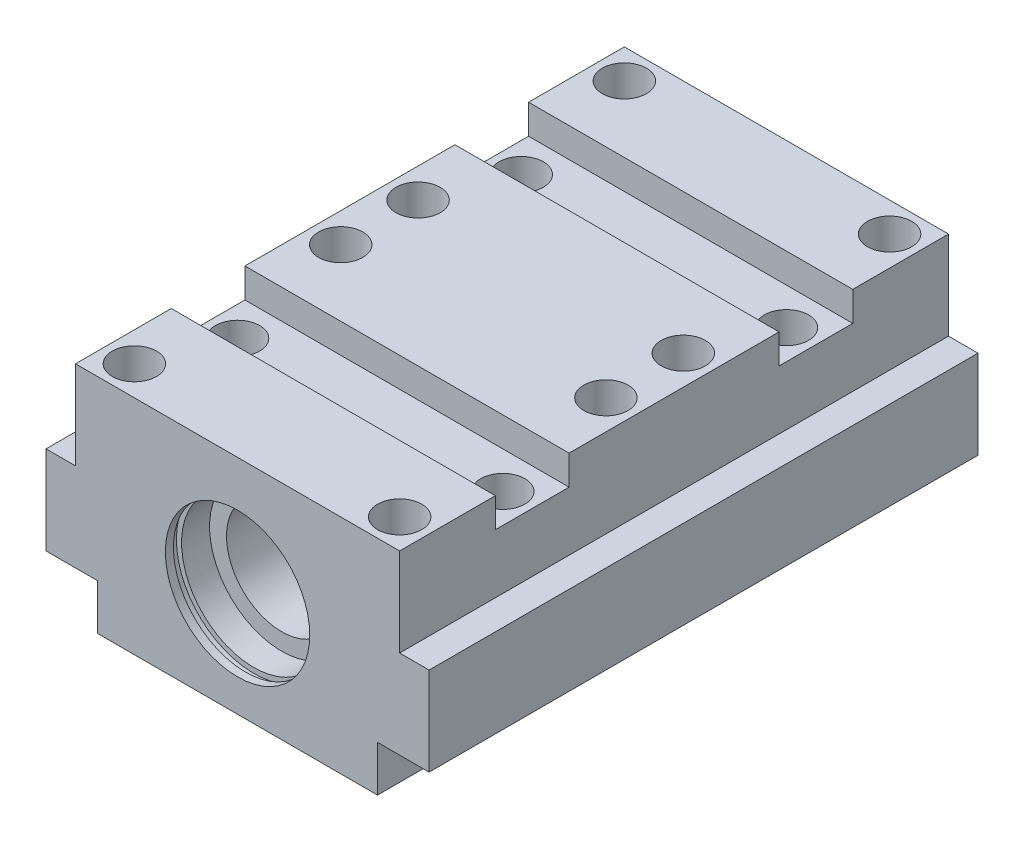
ISO-10303-21;
HEADER;
FILE_DESCRIPTION(('STEP AP214'),'2;1');
FILE_NAME('part.step','',(''),(''),'','','');
FILE_SCHEMA(('AUTOMOTIVE_DESIGN { 1 0 10303 214 1 1 1 1 }'));
ENDSEC;
DATA;
#1=APPLICATION_CONTEXT('core data for automotive mechanical design processes');
#2=APPLICATION_PROTOCOL_DEFINITION('international standard','automotive_design',2000,#1);
#3=PRODUCT_CONTEXT('',#1,'mechanical');
#4=PRODUCT('Part','Part','',(#3));
#5=PRODUCT_RELATED_PRODUCT_CATEGORY('part','',(#4));
#6=PRODUCT_DEFINITION_FORMATION('','',#4);
#7=PRODUCT_DEFINITION_CONTEXT('part definition',#1,'design');
#8=PRODUCT_DEFINITION('design','',#6,#7);
#9=PRODUCT_DEFINITION_SHAPE('','',#8);
#10=(LENGTH_UNIT() NAMED_UNIT(*) SI_UNIT(.MILLI.,.METRE.));
#11=(NAMED_UNIT(*) PLANE_ANGLE_UNIT() SI_UNIT($,.RADIAN.));
#12=(NAMED_UNIT(*) SI_UNIT($,.STERADIAN.) SOLID_ANGLE_UNIT());
#13=UNCERTAINTY_MEASURE_WITH_UNIT(LENGTH_MEASURE(1.E-05),#10,'distance_accuracy_value','');
#14=(GEOMETRIC_REPRESENTATION_CONTEXT(3) GLOBAL_UNCERTAINTY_ASSIGNED_CONTEXT((#13)) GLOBAL_UNIT_ASSIGNED_CONTEXT((#10,
#11,#12)) REPRESENTATION_CONTEXT('',''));
#15=CARTESIAN_POINT('',(0.,0.,0.));
#16=DIRECTION('',(0.,0.,1.));
#17=DIRECTION('',(1.,0.,0.));
#18=AXIS2_PLACEMENT_3D('',#15,#16,#17);
#19=CARTESIAN_POINT('',(-22.,0.,37.25));
#20=DIRECTION('',(0.,-1.,0.));
#21=DIRECTION('',(1.,0.,0.));
#22=AXIS2_PLACEMENT_3D('',#19,#20,#21);
#23=PLANE('',#22);
#24=CARTESIAN_POINT('',(-18.,0.,33.25));
#25=DIRECTION('',(0.,1.,0.));
#26=DIRECTION('',(-1.,0.,0.));
#27=AXIS2_PLACEMENT_3D('',#24,#25,#26);
#28=CIRCLE('',#27,3.);
#29=CARTESIAN_POINT('',(-21.,0.,33.25));
#30=VERTEX_POINT('',#29);
#31=EDGE_CURVE('E1193',#30,#30,#28,.T.);
#32=ORIENTED_EDGE('',*,*,#31,.F.);
#33=EDGE_LOOP('',(#32));
#34=FACE_BOUND('',#33,.T.);
#35=CARTESIAN_POINT('',(18.,0.,33.25));
#36=DIRECTION('',(0.,1.,0.));
#37=DIRECTION('',(-1.,0.,0.));
#38=AXIS2_PLACEMENT_3D('',#35,#36,#37);
#39=CIRCLE('',#38,3.);
#40=CARTESIAN_POINT('',(15.,0.,33.25));
#41=VERTEX_POINT('',#40);
#42=EDGE_CURVE('E1199',#41,#41,#39,.T.);
#43=ORIENTED_EDGE('',*,*,#42,.F.);
#44=EDGE_LOOP('',(#43));
#45=FACE_BOUND('',#44,.T.);
#46=DIRECTION('',(1.,0.,0.));
#47=VECTOR('',#46,1.);
#48=CARTESIAN_POINT('',(-22.,0.,37.25));
#49=LINE('',#48,#47);
#50=CARTESIAN_POINT('',(22.,0.,37.25));
#51=VERTEX_POINT('',#50);
#52=CARTESIAN_POINT('',(-22.,0.,37.25));
#53=VERTEX_POINT('',#52);
#54=EDGE_CURVE('E326',#51,#53,#49,.F.);
#55=ORIENTED_EDGE('',*,*,#54,.F.);
#56=DIRECTION('',(0.,0.,-1.));
#57=VECTOR('',#56,1.);
#58=CARTESIAN_POINT('',(22.,0.,37.25));
#59=LINE('',#58,#57);
#60=CARTESIAN_POINT('',(22.,0.,24.25));
#61=VERTEX_POINT('',#60);
#62=EDGE_CURVE('E271',#61,#51,#59,.F.);
#63=ORIENTED_EDGE('',*,*,#62,.F.);
#64=DIRECTION('',(1.,0.,0.));
#65=VECTOR('',#64,1.);
#66=CARTESIAN_POINT('',(-22.,0.,24.25));
#67=LINE('',#66,#65);
#68=CARTESIAN_POINT('',(-22.,0.,24.25));
#69=VERTEX_POINT('',#68);
#70=EDGE_CURVE('E334',#61,#69,#67,.F.);
#71=ORIENTED_EDGE('',*,*,#70,.T.);
#72=DIRECTION('',(0.,0.,-1.));
#73=VECTOR('',#72,1.);
#74=CARTESIAN_POINT('',(-22.,0.,37.25));
#75=LINE('',#74,#73);
#76=EDGE_CURVE('E263',#69,#53,#75,.F.);
#77=ORIENTED_EDGE('',*,*,#76,.T.);
#78=EDGE_LOOP('',(#55,#63,#71,#77));
#79=FACE_BOUND('',#78,.T.);
#80=ADVANCED_FACE('F17',(#34,#45,#79),#23,.F.);
#81=CARTESIAN_POINT('',(0.,0.,37.25));
#82=DIRECTION('',(0.,0.,-1.));
#83=DIRECTION('',(-1.,0.,0.));
#84=AXIS2_PLACEMENT_3D('',#81,#82,#83);
#85=PLANE('',#84);
#86=DIRECTION('',(0.,-1.,0.));
#87=VECTOR('',#86,1.);
#88=CARTESIAN_POINT('',(-22.,0.,37.25));
#89=LINE('',#88,#87);
#90=CARTESIAN_POINT('',(-22.,-12.,37.25));
#91=VERTEX_POINT('',#90);
#92=EDGE_CURVE('E288',#91,#53,#89,.F.);
#93=ORIENTED_EDGE('',*,*,#92,.F.);
#94=DIRECTION('',(1.,0.,0.));
#95=VECTOR('',#94,1.);
#96=CARTESIAN_POINT('',(-26.,-12.,37.25));
#97=LINE('',#96,#95);
#98=CARTESIAN_POINT('',(-26.,-12.,37.25));
#99=VERTEX_POINT('',#98);
#100=EDGE_CURVE('E331',#91,#99,#97,.F.);
#101=ORIENTED_EDGE('',*,*,#100,.T.);
#102=DIRECTION('',(0.,1.,0.));
#103=VECTOR('',#102,1.);
#104=CARTESIAN_POINT('',(-26.,-24.,37.25));
#105=LINE('',#104,#103);
#106=CARTESIAN_POINT('',(-26.,-24.,37.25));
#107=VERTEX_POINT('',#106);
#108=EDGE_CURVE('E286',#99,#107,#105,.F.);
#109=ORIENTED_EDGE('',*,*,#108,.T.);
#110=DIRECTION('',(1.,0.,0.));
#111=VECTOR('',#110,1.);
#112=CARTESIAN_POINT('',(0.,-24.,37.25));
#113=LINE('',#112,#111);
#114=CARTESIAN_POINT('',(-19.,-24.,37.25));
#115=VERTEX_POINT('',#114);
#116=EDGE_CURVE('E328',#115,#107,#113,.F.);
#117=ORIENTED_EDGE('',*,*,#116,.F.);
#118=DIRECTION('',(0.,1.,0.));
#119=VECTOR('',#118,1.);
#120=CARTESIAN_POINT('',(-19.,-30.2,37.25));
#121=LINE('',#120,#119);
#122=CARTESIAN_POINT('',(-19.,-30.2,37.25));
#123=VERTEX_POINT('',#122);
#124=EDGE_CURVE('E34',#115,#123,#121,.F.);
#125=ORIENTED_EDGE('',*,*,#124,.T.);
#126=DIRECTION('',(1.,0.,0.));
#127=VECTOR('',#126,1.);
#128=CARTESIAN_POINT('',(0.,-30.2,37.25));
#129=LINE('',#128,#127);
#130=CARTESIAN_POINT('',(19.,-30.2,37.25));
#131=VERTEX_POINT('',#130);
#132=EDGE_CURVE('E363',#131,#123,#129,.F.);
#133=ORIENTED_EDGE('',*,*,#132,.F.);
#134=DIRECTION('',(0.,1.,0.));
#135=VECTOR('',#134,1.);
#136=CARTESIAN_POINT('',(19.,0.,37.25));
#137=LINE('',#136,#135);
#138=CARTESIAN_POINT('',(19.,-24.,37.25));
#139=VERTEX_POINT('',#138);
#140=EDGE_CURVE('E42',#139,#131,#137,.F.);
#141=ORIENTED_EDGE('',*,*,#140,.F.);
#142=DIRECTION('',(-1.,0.,0.));
#143=VECTOR('',#142,1.);
#144=CARTESIAN_POINT('',(26.,-24.,37.25));
#145=LINE('',#144,#143);
#146=CARTESIAN_POINT('',(26.,-24.,37.25));
#147=VERTEX_POINT('',#146);
#148=EDGE_CURVE('E320',#139,#147,#145,.F.);
#149=ORIENTED_EDGE('',*,*,#148,.T.);
#150=DIRECTION('',(0.,1.,0.));
#151=VECTOR('',#150,1.);
#152=CARTESIAN_POINT('',(26.,0.,37.25));
#153=LINE('',#152,#151);
#154=CARTESIAN_POINT('',(26.,-12.,37.25));
#155=VERTEX_POINT('',#154);
#156=EDGE_CURVE('E293',#155,#147,#153,.F.);
#157=ORIENTED_EDGE('',*,*,#156,.F.);
#158=DIRECTION('',(-1.,0.,0.));
#159=VECTOR('',#158,1.);
#160=CARTESIAN_POINT('',(0.,-12.,37.25));
#161=LINE('',#160,#159);
#162=CARTESIAN_POINT('',(22.,-12.,37.25));
#163=VERTEX_POINT('',#162);
#164=EDGE_CURVE('E323',#163,#155,#161,.F.);
#165=ORIENTED_EDGE('',*,*,#164,.F.);
#166=DIRECTION('',(0.,-1.,0.));
#167=VECTOR('',#166,1.);
#168=CARTESIAN_POINT('',(22.,0.,37.25));
#169=LINE('',#168,#167);
#170=EDGE_CURVE('E296',#163,#51,#169,.F.);
#171=ORIENTED_EDGE('',*,*,#170,.T.);
#172=ORIENTED_EDGE('',*,*,#54,.T.);
#173=EDGE_LOOP('',(#93,#101,#109,#117,#125,#133,#141,#149,#157,#165,#171,#172));
#174=FACE_BOUND('',#173,.T.);
#175=CARTESIAN_POINT('',(0.,-16.,37.25));
#176=DIRECTION('',(0.,0.,-1.));
#177=DIRECTION('',(-1.,0.,0.));
#178=AXIS2_PLACEMENT_3D('',#175,#176,#177);
#179=CIRCLE('',#178,9.8);
#180=CARTESIAN_POINT('',(-9.8,-16.,37.25));
#181=VERTEX_POINT('',#180);
#182=EDGE_CURVE('E11',#181,#181,#179,.T.);
#183=ORIENTED_EDGE('',*,*,#182,.T.);
#184=EDGE_LOOP('',(#183));
#185=FACE_BOUND('',#184,.T.);
#186=ADVANCED_FACE('F447',(#174,#185),#85,.F.);
#187=CARTESIAN_POINT('',(-22.,0.,37.25));
#188=DIRECTION('',(0.,-1.,0.));
#189=DIRECTION('',(1.,0.,0.));
#190=AXIS2_PLACEMENT_3D('',#187,#188,#189);
#191=PLANE('',#190);
#192=CARTESIAN_POINT('',(-18.,0.,5.25));
#193=DIRECTION('',(0.,1.,0.));
#194=DIRECTION('',(-1.,0.,0.));
#195=AXIS2_PLACEMENT_3D('',#192,#193,#194);
#196=CIRCLE('',#195,3.);
#197=CARTESIAN_POINT('',(-21.,0.,5.25));
#198=VERTEX_POINT('',#197);
#199=EDGE_CURVE('E1164',#198,#198,#196,.T.);
#200=ORIENTED_EDGE('',*,*,#199,.F.);
#201=EDGE_LOOP('',(#200));
#202=FACE_BOUND('',#201,.T.);
#203=CARTESIAN_POINT('',(18.,0.,-5.25));
#204=DIRECTION('',(0.,1.,0.));
#205=DIRECTION('',(-1.,0.,0.));
#206=AXIS2_PLACEMENT_3D('',#203,#204,#205);
#207=CIRCLE('',#206,3.);
#208=CARTESIAN_POINT('',(15.,0.,-5.25));
#209=VERTEX_POINT('',#208);
#210=EDGE_CURVE('E1170',#209,#209,#207,.T.);
#211=ORIENTED_EDGE('',*,*,#210,.F.);
#212=EDGE_LOOP('',(#211));
#213=FACE_BOUND('',#212,.T.);
#214=CARTESIAN_POINT('',(-18.,0.,-5.25));
#215=DIRECTION('',(0.,1.,0.));
#216=DIRECTION('',(-1.,0.,0.));
#217=AXIS2_PLACEMENT_3D('',#214,#215,#216);
#218=CIRCLE('',#217,3.);
#219=CARTESIAN_POINT('',(-21.,0.,-5.25));
#220=VERTEX_POINT('',#219);
#221=EDGE_CURVE('E1151',#220,#220,#218,.T.);
#222=ORIENTED_EDGE('',*,*,#221,.F.);
#223=EDGE_LOOP('',(#222));
#224=FACE_BOUND('',#223,.T.);
#225=CARTESIAN_POINT('',(18.,0.,5.25));
#226=DIRECTION('',(0.,1.,0.));
#227=DIRECTION('',(-1.,0.,0.));
#228=AXIS2_PLACEMENT_3D('',#225,#226,#227);
#229=CIRCLE('',#228,3.);
#230=CARTESIAN_POINT('',(15.,0.,5.25));
#231=VERTEX_POINT('',#230);
#232=EDGE_CURVE('E1179',#231,#231,#229,.T.);
#233=ORIENTED_EDGE('',*,*,#232,.F.);
#234=EDGE_LOOP('',(#233));
#235=FACE_BOUND('',#234,.T.);
#236=DIRECTION('',(0.,0.,-1.));
#237=VECTOR('',#236,1.);
#238=CARTESIAN_POINT('',(22.,0.,37.25));
#239=LINE('',#238,#237);
#240=CARTESIAN_POINT('',(22.,0.,-14.25));
#241=VERTEX_POINT('',#240);
#242=CARTESIAN_POINT('',(22.,0.,14.25));
#243=VERTEX_POINT('',#242);
#244=EDGE_CURVE('E238',#241,#243,#239,.F.);
#245=ORIENTED_EDGE('',*,*,#244,.F.);
#246=DIRECTION('',(1.,0.,0.));
#247=VECTOR('',#246,1.);
#248=CARTESIAN_POINT('',(-22.,0.,-14.25));
#249=LINE('',#248,#247);
#250=CARTESIAN_POINT('',(-22.,0.,-14.25));
#251=VERTEX_POINT('',#250);
#252=EDGE_CURVE('E338',#241,#251,#249,.F.);
#253=ORIENTED_EDGE('',*,*,#252,.T.);
#254=DIRECTION('',(0.,0.,-1.));
#255=VECTOR('',#254,1.);
#256=CARTESIAN_POINT('',(-22.,0.,37.25));
#257=LINE('',#256,#255);
#258=CARTESIAN_POINT('',(-22.,0.,14.25));
#259=VERTEX_POINT('',#258);
#260=EDGE_CURVE('E266',#251,#259,#257,.F.);
#261=ORIENTED_EDGE('',*,*,#260,.T.);
#262=DIRECTION('',(1.,0.,0.));
#263=VECTOR('',#262,1.);
#264=CARTESIAN_POINT('',(-22.,0.,14.25));
#265=LINE('',#264,#263);
#266=EDGE_CURVE('E336',#243,#259,#265,.F.);
#267=ORIENTED_EDGE('',*,*,#266,.F.);
#268=EDGE_LOOP('',(#245,#253,#261,#267));
#269=FACE_BOUND('',#268,.T.);
#270=ADVANCED_FACE('F470',(#202,#213,#224,#235,#269),#191,.F.);
#271=CARTESIAN_POINT('',(0.,-4.,0.));
#272=DIRECTION('',(0.,-1.,0.));
#273=DIRECTION('',(0.,0.,-1.));
#274=AXIS2_PLACEMENT_3D('',#271,#272,#273);
#275=PLANE('',#274);
#276=CARTESIAN_POINT('',(-18.,-4.,-19.2500000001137));
#277=DIRECTION('',(0.,-1.,0.));
#278=DIRECTION('',(0.,0.,-1.));
#279=AXIS2_PLACEMENT_3D('',#276,#277,#278);
#280=CIRCLE('',#279,3.);
#281=CARTESIAN_POINT('',(-18.,-4.,-22.2500000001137));
#282=VERTEX_POINT('',#281);
#283=EDGE_CURVE('E21',#282,#282,#280,.F.);
#284=ORIENTED_EDGE('',*,*,#283,.F.);
#285=EDGE_LOOP('',(#284));
#286=FACE_BOUND('',#285,.T.);
#287=CARTESIAN_POINT('',(18.,-4.,-19.2500000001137));
#288=DIRECTION('',(0.,-1.,0.));
#289=DIRECTION('',(0.,0.,-1.));
#290=AXIS2_PLACEMENT_3D('',#287,#288,#289);
#291=CIRCLE('',#290,3.);
#292=CARTESIAN_POINT('',(18.,-4.,-22.2500000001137));
#293=VERTEX_POINT('',#292);
#294=EDGE_CURVE('E367',#293,#293,#291,.F.);
#295=ORIENTED_EDGE('',*,*,#294,.F.);
#296=EDGE_LOOP('',(#295));
#297=FACE_BOUND('',#296,.T.);
#298=DIRECTION('',(0.,0.,1.));
#299=VECTOR('',#298,1.);
#300=CARTESIAN_POINT('',(22.,-4.,37.25));
#301=LINE('',#300,#299);
#302=CARTESIAN_POINT('',(22.,-4.,-14.25));
#303=VERTEX_POINT('',#302);
#304=CARTESIAN_POINT('',(22.,-4.,-24.25));
#305=VERTEX_POINT('',#304);
#306=EDGE_CURVE('E176',#303,#305,#301,.F.);
#307=ORIENTED_EDGE('',*,*,#306,.T.);
#308=DIRECTION('',(1.,0.,0.));
#309=VECTOR('',#308,1.);
#310=CARTESIAN_POINT('',(0.,-4.,-24.25));
#311=LINE('',#310,#309);
#312=CARTESIAN_POINT('',(-22.,-4.,-24.25));
#313=VERTEX_POINT('',#312);
#314=EDGE_CURVE('E170',#313,#305,#311,.T.);
#315=ORIENTED_EDGE('',*,*,#314,.F.);
#316=DIRECTION('',(0.,0.,-1.));
#317=VECTOR('',#316,1.);
#318=CARTESIAN_POINT('',(-22.,-4.,37.25));
#319=LINE('',#318,#317);
#320=CARTESIAN_POINT('',(-22.,-4.,-14.25));
#321=VERTEX_POINT('',#320);
#322=EDGE_CURVE('E174',#313,#321,#319,.F.);
#323=ORIENTED_EDGE('',*,*,#322,.T.);
#324=DIRECTION('',(1.,0.,0.));
#325=VECTOR('',#324,1.);
#326=CARTESIAN_POINT('',(0.,-4.,-14.25));
#327=LINE('',#326,#325);
#328=EDGE_CURVE('E181',#303,#321,#327,.F.);
#329=ORIENTED_EDGE('',*,*,#328,.F.);
#330=EDGE_LOOP('',(#307,#315,#323,#329));
#331=FACE_BOUND('',#330,.T.);
#332=ADVANCED_FACE('F172',(#286,#297,#331),#275,.F.);
#333=CARTESIAN_POINT('',(-22.,0.,37.25));
#334=DIRECTION('',(0.,-1.,0.));
#335=DIRECTION('',(1.,0.,0.));
#336=AXIS2_PLACEMENT_3D('',#333,#334,#335);
#337=PLANE('',#336);
#338=CARTESIAN_POINT('',(18.,0.,-33.25));
#339=DIRECTION('',(0.,1.,0.));
#340=DIRECTION('',(-1.,0.,0.));
#341=AXIS2_PLACEMENT_3D('',#338,#339,#340);
#342=CIRCLE('',#341,3.);
#343=CARTESIAN_POINT('',(15.,0.,-33.25));
#344=VERTEX_POINT('',#343);
#345=EDGE_CURVE('E1229',#344,#344,#342,.T.);
#346=ORIENTED_EDGE('',*,*,#345,.F.);
#347=EDGE_LOOP('',(#346));
#348=FACE_BOUND('',#347,.T.);
#349=CARTESIAN_POINT('',(-18.,0.,-33.25));
#350=DIRECTION('',(0.,1.,0.));
#351=DIRECTION('',(-1.,0.,0.));
#352=AXIS2_PLACEMENT_3D('',#349,#350,#351);
#353=CIRCLE('',#352,3.);
#354=CARTESIAN_POINT('',(-21.,0.,-33.25));
#355=VERTEX_POINT('',#354);
#356=EDGE_CURVE('E1235',#355,#355,#353,.T.);
#357=ORIENTED_EDGE('',*,*,#356,.F.);
#358=EDGE_LOOP('',(#357));
#359=FACE_BOUND('',#358,.T.);
#360=DIRECTION('',(0.,0.,-1.));
#361=VECTOR('',#360,1.);
#362=CARTESIAN_POINT('',(22.,0.,37.25));
#363=LINE('',#362,#361);
#364=CARTESIAN_POINT('',(22.,0.,-37.25));
#365=VERTEX_POINT('',#364);
#366=CARTESIAN_POINT('',(22.,0.,-24.25));
#367=VERTEX_POINT('',#366);
#368=EDGE_CURVE('E240',#365,#367,#363,.F.);
#369=ORIENTED_EDGE('',*,*,#368,.F.);
#370=DIRECTION('',(-1.,0.,0.));
#371=VECTOR('',#370,1.);
#372=CARTESIAN_POINT('',(0.,0.,-37.25));
#373=LINE('',#372,#371);
#374=CARTESIAN_POINT('',(-22.,0.,-37.25));
#375=VERTEX_POINT('',#374);
#376=EDGE_CURVE('E345',#365,#375,#373,.T.);
#377=ORIENTED_EDGE('',*,*,#376,.T.);
#378=DIRECTION('',(0.,0.,-1.));
#379=VECTOR('',#378,1.);
#380=CARTESIAN_POINT('',(-22.,0.,37.25));
#381=LINE('',#380,#379);
#382=CARTESIAN_POINT('',(-22.,0.,-24.25));
#383=VERTEX_POINT('',#382);
#384=EDGE_CURVE('E269',#375,#383,#381,.F.);
#385=ORIENTED_EDGE('',*,*,#384,.T.);
#386=DIRECTION('',(1.,0.,0.));
#387=VECTOR('',#386,1.);
#388=CARTESIAN_POINT('',(-22.,0.,-24.25));
#389=LINE('',#388,#387);
#390=EDGE_CURVE('E188',#367,#383,#389,.F.);
#391=ORIENTED_EDGE('',*,*,#390,.F.);
#392=EDGE_LOOP('',(#369,#377,#385,#391));
#393=FACE_BOUND('',#392,.T.);
#394=ADVANCED_FACE('F411',(#348,#359,#393),#337,.F.);
#395=CARTESIAN_POINT('',(19.,-28.5,-24.25));
#396=DIRECTION('',(0.,0.,1.));
#397=DIRECTION('',(1.,0.,0.));
#398=AXIS2_PLACEMENT_3D('',#395,#396,#397);
#399=PLANE('',#398);
#400=DIRECTION('',(0.,1.,0.));
#401=VECTOR('',#400,1.);
#402=CARTESIAN_POINT('',(19.,-24.,-24.25));
#403=LINE('',#402,#401);
#404=CARTESIAN_POINT('',(19.,-28.5,-24.25));
#405=VERTEX_POINT('',#404);
#406=CARTESIAN_POINT('',(19.,-30.2,-24.25));
#407=VERTEX_POINT('',#406);
#408=EDGE_CURVE('E314',#405,#407,#403,.F.);
#409=ORIENTED_EDGE('',*,*,#408,.T.);
#410=DIRECTION('',(1.,0.,0.));
#411=VECTOR('',#410,1.);
#412=CARTESIAN_POINT('',(19.,-30.2,-24.25));
#413=LINE('',#412,#411);
#414=CARTESIAN_POINT('',(-19.,-30.2,-24.25));
#415=VERTEX_POINT('',#414);
#416=EDGE_CURVE('E357',#407,#415,#413,.F.);
#417=ORIENTED_EDGE('',*,*,#416,.T.);
#418=DIRECTION('',(0.,1.,0.));
#419=VECTOR('',#418,1.);
#420=CARTESIAN_POINT('',(-19.,-28.5,-24.25));
#421=LINE('',#420,#419);
#422=CARTESIAN_POINT('',(-19.,-28.5,-24.25));
#423=VERTEX_POINT('',#422);
#424=EDGE_CURVE('E317',#423,#415,#421,.F.);
#425=ORIENTED_EDGE('',*,*,#424,.F.);
#426=DIRECTION('',(1.,0.,0.));
#427=VECTOR('',#426,1.);
#428=CARTESIAN_POINT('',(19.,-28.5,-24.25));
#429=LINE('',#428,#427);
#430=EDGE_CURVE('E391',#405,#423,#429,.F.);
#431=ORIENTED_EDGE('',*,*,#430,.F.);
#432=EDGE_LOOP('',(#409,#417,#425,#431));
#433=FACE_BOUND('',#432,.T.);
#434=ADVANCED_FACE('F479',(#433),#399,.F.);
#435=CARTESIAN_POINT('',(19.,-30.2,37.25));
#436=DIRECTION('',(0.,1.,0.));
#437=DIRECTION('',(-1.,0.,0.));
#438=AXIS2_PLACEMENT_3D('',#435,#436,#437);
#439=PLANE('',#438);
#440=DIRECTION('',(0.,0.,1.));
#441=VECTOR('',#440,1.);
#442=CARTESIAN_POINT('',(-19.,-30.2,37.25));
#443=LINE('',#442,#441);
#444=EDGE_CURVE('E256',#123,#415,#443,.F.);
#445=ORIENTED_EDGE('',*,*,#444,.T.);
#446=ORIENTED_EDGE('',*,*,#416,.F.);
#447=DIRECTION('',(0.,0.,-1.));
#448=VECTOR('',#447,1.);
#449=CARTESIAN_POINT('',(19.,-30.2,37.25));
#450=LINE('',#449,#448);
#451=EDGE_CURVE('E248',#407,#131,#450,.F.);
#452=ORIENTED_EDGE('',*,*,#451,.T.);
#453=ORIENTED_EDGE('',*,*,#132,.T.);
#454=EDGE_LOOP('',(#445,#446,#452,#453));
#455=FACE_BOUND('',#454,.T.);
#456=ADVANCED_FACE('F476',(#455),#439,.F.);
#457=CARTESIAN_POINT('',(-22.,-4.,24.25));
#458=DIRECTION('',(0.,0.,1.));
#459=DIRECTION('',(1.,0.,0.));
#460=AXIS2_PLACEMENT_3D('',#457,#458,#459);
#461=PLANE('',#460);
#462=DIRECTION('',(0.,-1.,0.));
#463=VECTOR('',#462,1.);
#464=CARTESIAN_POINT('',(22.,-4.,24.25));
#465=LINE('',#464,#463);
#466=CARTESIAN_POINT('',(22.,-4.,24.25));
#467=VERTEX_POINT('',#466);
#468=EDGE_CURVE('E299',#467,#61,#465,.F.);
#469=ORIENTED_EDGE('',*,*,#468,.F.);
#470=DIRECTION('',(1.,0.,0.));
#471=VECTOR('',#470,1.);
#472=CARTESIAN_POINT('',(0.,-4.,24.25));
#473=LINE('',#472,#471);
#474=CARTESIAN_POINT('',(-22.,-4.,24.25));
#475=VERTEX_POINT('',#474);
#476=EDGE_CURVE('E206',#475,#467,#473,.T.);
#477=ORIENTED_EDGE('',*,*,#476,.F.);
#478=DIRECTION('',(0.,-1.,0.));
#479=VECTOR('',#478,1.);
#480=CARTESIAN_POINT('',(-22.,-12.,24.25));
#481=LINE('',#480,#479);
#482=EDGE_CURVE('E283',#475,#69,#481,.F.);
#483=ORIENTED_EDGE('',*,*,#482,.T.);
#484=ORIENTED_EDGE('',*,*,#70,.F.);
#485=EDGE_LOOP('',(#469,#477,#483,#484));
#486=FACE_BOUND('',#485,.T.);
#487=ADVANCED_FACE('F459',(#486),#461,.F.);
#488=CARTESIAN_POINT('',(-22.,-4.,14.25));
#489=DIRECTION('',(0.,0.,-1.));
#490=DIRECTION('',(-1.,0.,0.));
#491=AXIS2_PLACEMENT_3D('',#488,#489,#490);
#492=PLANE('',#491);
#493=DIRECTION('',(0.,-1.,0.));
#494=VECTOR('',#493,1.);
#495=CARTESIAN_POINT('',(-22.,-4.,14.25));
#496=LINE('',#495,#494);
#497=CARTESIAN_POINT('',(-22.,-4.,14.25));
#498=VERTEX_POINT('',#497);
#499=EDGE_CURVE('E280',#498,#259,#496,.F.);
#500=ORIENTED_EDGE('',*,*,#499,.F.);
#501=DIRECTION('',(1.,0.,0.));
#502=VECTOR('',#501,1.);
#503=CARTESIAN_POINT('',(0.,-4.,14.25));
#504=LINE('',#503,#502);
#505=CARTESIAN_POINT('',(22.,-4.,14.25));
#506=VERTEX_POINT('',#505);
#507=EDGE_CURVE('E208',#506,#498,#504,.F.);
#508=ORIENTED_EDGE('',*,*,#507,.F.);
#509=DIRECTION('',(0.,-1.,0.));
#510=VECTOR('',#509,1.);
#511=CARTESIAN_POINT('',(22.,0.,14.25));
#512=LINE('',#511,#510);
#513=EDGE_CURVE('E301',#506,#243,#512,.F.);
#514=ORIENTED_EDGE('',*,*,#513,.T.);
#515=ORIENTED_EDGE('',*,*,#266,.T.);
#516=EDGE_LOOP('',(#500,#508,#514,#515));
#517=FACE_BOUND('',#516,.T.);
#518=ADVANCED_FACE('F465',(#517),#492,.F.);
#519=CARTESIAN_POINT('',(-22.,-4.,-14.25));
#520=DIRECTION('',(0.,0.,1.));
#521=DIRECTION('',(1.,0.,0.));
#522=AXIS2_PLACEMENT_3D('',#519,#520,#521);
#523=PLANE('',#522);
#524=DIRECTION('',(0.,-1.,0.));
#525=VECTOR('',#524,1.);
#526=CARTESIAN_POINT('',(-22.,-12.,-14.25));
#527=LINE('',#526,#525);
#528=EDGE_CURVE('E191',#321,#251,#527,.F.);
#529=ORIENTED_EDGE('',*,*,#528,.T.);
#530=ORIENTED_EDGE('',*,*,#252,.F.);
#531=DIRECTION('',(0.,-1.,0.));
#532=VECTOR('',#531,1.);
#533=CARTESIAN_POINT('',(22.,-4.,-14.25));
#534=LINE('',#533,#532);
#535=EDGE_CURVE('E304',#303,#241,#534,.F.);
#536=ORIENTED_EDGE('',*,*,#535,.F.);
#537=ORIENTED_EDGE('',*,*,#328,.T.);
#538=EDGE_LOOP('',(#529,#530,#536,#537));
#539=FACE_BOUND('',#538,.T.);
#540=ADVANCED_FACE('F474',(#539),#523,.F.);
#541=CARTESIAN_POINT('',(-22.,-4.,-24.25));
#542=DIRECTION('',(0.,0.,-1.));
#543=DIRECTION('',(-1.,0.,0.));
#544=AXIS2_PLACEMENT_3D('',#541,#542,#543);
#545=PLANE('',#544);
#546=DIRECTION('',(0.,-1.,0.));
#547=VECTOR('',#546,1.);
#548=CARTESIAN_POINT('',(22.,0.,-24.25));
#549=LINE('',#548,#547);
#550=EDGE_CURVE('E306',#305,#367,#549,.F.);
#551=ORIENTED_EDGE('',*,*,#550,.T.);
#552=ORIENTED_EDGE('',*,*,#390,.T.);
#553=DIRECTION('',(0.,-1.,0.));
#554=VECTOR('',#553,1.);
#555=CARTESIAN_POINT('',(-22.,-4.,-24.25));
#556=LINE('',#555,#554);
#557=EDGE_CURVE('E185',#313,#383,#556,.F.);
#558=ORIENTED_EDGE('',*,*,#557,.F.);
#559=ORIENTED_EDGE('',*,*,#314,.T.);
#560=EDGE_LOOP('',(#551,#552,#558,#559));
#561=FACE_BOUND('',#560,.T.);
#562=ADVANCED_FACE('F186',(#561),#545,.F.);
#563=CARTESIAN_POINT('',(0.,-28.5,0.));
#564=DIRECTION('',(0.,-1.,0.));
#565=DIRECTION('',(0.,0.,-1.));
#566=AXIS2_PLACEMENT_3D('',#563,#564,#565);
#567=PLANE('',#566);
#568=DIRECTION('',(0.,0.,-1.));
#569=VECTOR('',#568,1.);
#570=CARTESIAN_POINT('',(19.,-28.5,0.));
#571=LINE('',#570,#569);
#572=CARTESIAN_POINT('',(19.,-28.5,-37.25));
#573=VERTEX_POINT('',#572);
#574=EDGE_CURVE('E250',#405,#573,#571,.T.);
#575=ORIENTED_EDGE('',*,*,#574,.F.);
#576=ORIENTED_EDGE('',*,*,#430,.T.);
#577=DIRECTION('',(0.,0.,-1.));
#578=VECTOR('',#577,1.);
#579=CARTESIAN_POINT('',(-19.,-28.5,37.25));
#580=LINE('',#579,#578);
#581=CARTESIAN_POINT('',(-19.,-28.5,-37.25));
#582=VERTEX_POINT('',#581);
#583=EDGE_CURVE('E253',#423,#582,#580,.T.);
#584=ORIENTED_EDGE('',*,*,#583,.T.);
#585=DIRECTION('',(-1.,0.,0.));
#586=VECTOR('',#585,1.);
#587=CARTESIAN_POINT('',(0.,-28.5,-37.25));
#588=LINE('',#587,#586);
#589=EDGE_CURVE('E354',#582,#573,#588,.F.);
#590=ORIENTED_EDGE('',*,*,#589,.T.);
#591=EDGE_LOOP('',(#575,#576,#584,#590));
#592=FACE_BOUND('',#591,.T.);
#593=ADVANCED_FACE('F435',(#592),#567,.T.);
#594=CARTESIAN_POINT('',(19.,-24.,37.25));
#595=DIRECTION('',(-1.,0.,0.));
#596=DIRECTION('',(0.,0.,1.));
#597=AXIS2_PLACEMENT_3D('',#594,#595,#596);
#598=PLANE('',#597);
#599=ORIENTED_EDGE('',*,*,#408,.F.);
#600=ORIENTED_EDGE('',*,*,#574,.T.);
#601=DIRECTION('',(0.,-1.,0.));
#602=VECTOR('',#601,1.);
#603=CARTESIAN_POINT('',(19.,-24.,-37.25));
#604=LINE('',#603,#602);
#605=CARTESIAN_POINT('',(19.,-24.,-37.25));
#606=VERTEX_POINT('',#605);
#607=EDGE_CURVE('E312',#606,#573,#604,.T.);
#608=ORIENTED_EDGE('',*,*,#607,.F.);
#609=DIRECTION('',(0.,0.,1.));
#610=VECTOR('',#609,1.);
#611=CARTESIAN_POINT('',(19.,-24.,37.25));
#612=LINE('',#611,#610);
#613=EDGE_CURVE('E393',#139,#606,#612,.F.);
#614=ORIENTED_EDGE('',*,*,#613,.F.);
#615=ORIENTED_EDGE('',*,*,#140,.T.);
#616=ORIENTED_EDGE('',*,*,#451,.F.);
#617=EDGE_LOOP('',(#599,#600,#608,#614,#615,#616));
#618=FACE_BOUND('',#617,.T.);
#619=ADVANCED_FACE('F431',(#618),#598,.F.);
#620=CARTESIAN_POINT('',(26.,-24.,37.25));
#621=DIRECTION('',(0.,1.,0.));
#622=DIRECTION('',(-1.,0.,0.));
#623=AXIS2_PLACEMENT_3D('',#620,#621,#622);
#624=PLANE('',#623);
#625=ORIENTED_EDGE('',*,*,#613,.T.);
#626=DIRECTION('',(1.,0.,0.));
#627=VECTOR('',#626,1.);
#628=CARTESIAN_POINT('',(0.,-24.,-37.25));
#629=LINE('',#628,#627);
#630=CARTESIAN_POINT('',(26.,-24.,-37.25));
#631=VERTEX_POINT('',#630);
#632=EDGE_CURVE('E360',#606,#631,#629,.T.);
#633=ORIENTED_EDGE('',*,*,#632,.T.);
#634=DIRECTION('',(0.,0.,1.));
#635=VECTOR('',#634,1.);
#636=CARTESIAN_POINT('',(26.,-24.,37.25));
#637=LINE('',#636,#635);
#638=EDGE_CURVE('E246',#147,#631,#637,.F.);
#639=ORIENTED_EDGE('',*,*,#638,.F.);
#640=ORIENTED_EDGE('',*,*,#148,.F.);
#641=EDGE_LOOP('',(#625,#633,#639,#640));
#642=FACE_BOUND('',#641,.T.);
#643=ADVANCED_FACE('F428',(#642),#624,.F.);
#644=CARTESIAN_POINT('',(26.,-12.,37.25));
#645=DIRECTION('',(-1.,0.,0.));
#646=DIRECTION('',(0.,0.,1.));
#647=AXIS2_PLACEMENT_3D('',#644,#645,#646);
#648=PLANE('',#647);
#649=DIRECTION('',(0.,0.,1.));
#650=VECTOR('',#649,1.);
#651=CARTESIAN_POINT('',(26.,-12.,37.25));
#652=LINE('',#651,#650);
#653=CARTESIAN_POINT('',(26.,-12.,-37.25));
#654=VERTEX_POINT('',#653);
#655=EDGE_CURVE('E243',#155,#654,#652,.F.);
#656=ORIENTED_EDGE('',*,*,#655,.F.);
#657=ORIENTED_EDGE('',*,*,#156,.T.);
#658=ORIENTED_EDGE('',*,*,#638,.T.);
#659=DIRECTION('',(0.,1.,0.));
#660=VECTOR('',#659,1.);
#661=CARTESIAN_POINT('',(26.,0.,-37.25));
#662=LINE('',#661,#660);
#663=EDGE_CURVE('E310',#631,#654,#662,.T.);
#664=ORIENTED_EDGE('',*,*,#663,.T.);
#665=EDGE_LOOP('',(#656,#657,#658,#664));
#666=FACE_BOUND('',#665,.T.);
#667=ADVANCED_FACE('F424',(#666),#648,.F.);
#668=CARTESIAN_POINT('',(22.,-12.,37.25));
#669=DIRECTION('',(0.,-1.,0.));
#670=DIRECTION('',(1.,0.,0.));
#671=AXIS2_PLACEMENT_3D('',#668,#669,#670);
#672=PLANE('',#671);
#673=DIRECTION('',(0.,0.,1.));
#674=VECTOR('',#673,1.);
#675=CARTESIAN_POINT('',(22.,-12.,37.25));
#676=LINE('',#675,#674);
#677=CARTESIAN_POINT('',(22.,-12.,-37.25));
#678=VERTEX_POINT('',#677);
#679=EDGE_CURVE('E395',#163,#678,#676,.F.);
#680=ORIENTED_EDGE('',*,*,#679,.F.);
#681=ORIENTED_EDGE('',*,*,#164,.T.);
#682=ORIENTED_EDGE('',*,*,#655,.T.);
#683=DIRECTION('',(1.,0.,0.));
#684=VECTOR('',#683,1.);
#685=CARTESIAN_POINT('',(22.,-12.,-37.25));
#686=LINE('',#685,#684);
#687=EDGE_CURVE('E342',#678,#654,#686,.T.);
#688=ORIENTED_EDGE('',*,*,#687,.F.);
#689=EDGE_LOOP('',(#680,#681,#682,#688));
#690=FACE_BOUND('',#689,.T.);
#691=ADVANCED_FACE('F421',(#690),#672,.F.);
#692=CARTESIAN_POINT('',(22.,0.,37.25));
#693=DIRECTION('',(-1.,0.,0.));
#694=DIRECTION('',(0.,0.,1.));
#695=AXIS2_PLACEMENT_3D('',#692,#693,#694);
#696=PLANE('',#695);
#697=DIRECTION('',(0.,0.,1.));
#698=VECTOR('',#697,1.);
#699=CARTESIAN_POINT('',(22.,-4.,37.25));
#700=LINE('',#699,#698);
#701=EDGE_CURVE('E398',#467,#506,#700,.F.);
#702=ORIENTED_EDGE('',*,*,#701,.F.);
#703=ORIENTED_EDGE('',*,*,#468,.T.);
#704=ORIENTED_EDGE('',*,*,#62,.T.);
#705=ORIENTED_EDGE('',*,*,#170,.F.);
#706=ORIENTED_EDGE('',*,*,#679,.T.);
#707=DIRECTION('',(0.,1.,0.));
#708=VECTOR('',#707,1.);
#709=CARTESIAN_POINT('',(22.,0.,-37.25));
#710=LINE('',#709,#708);
#711=EDGE_CURVE('E308',#678,#365,#710,.T.);
#712=ORIENTED_EDGE('',*,*,#711,.T.);
#713=ORIENTED_EDGE('',*,*,#368,.T.);
#714=ORIENTED_EDGE('',*,*,#550,.F.);
#715=ORIENTED_EDGE('',*,*,#306,.F.);
#716=ORIENTED_EDGE('',*,*,#535,.T.);
#717=ORIENTED_EDGE('',*,*,#244,.T.);
#718=ORIENTED_EDGE('',*,*,#513,.F.);
#719=EDGE_LOOP('',(#702,#703,#704,#705,#706,#712,#713,#714,#715,#716,#717,#718));
#720=FACE_BOUND('',#719,.T.);
#721=ADVANCED_FACE('F417',(#720),#696,.F.);
#722=CARTESIAN_POINT('',(0.,-4.,0.));
#723=DIRECTION('',(0.,1.,0.));
#724=DIRECTION('',(0.,0.,1.));
#725=AXIS2_PLACEMENT_3D('',#722,#723,#724);
#726=PLANE('',#725);
#727=CARTESIAN_POINT('',(-18.,-4.,19.25));
#728=DIRECTION('',(0.,1.,0.));
#729=DIRECTION('',(0.,0.,1.));
#730=AXIS2_PLACEMENT_3D('',#727,#728,#729);
#731=CIRCLE('',#730,3.);
#732=CARTESIAN_POINT('',(-18.,-4.,22.25));
#733=VERTEX_POINT('',#732);
#734=EDGE_CURVE('E1192',#733,#733,#731,.T.);
#735=ORIENTED_EDGE('',*,*,#734,.F.);
#736=EDGE_LOOP('',(#735));
#737=FACE_BOUND('',#736,.T.);
#738=CARTESIAN_POINT('',(18.,-4.,19.25));
#739=DIRECTION('',(0.,1.,0.));
#740=DIRECTION('',(0.,0.,1.));
#741=AXIS2_PLACEMENT_3D('',#738,#739,#740);
#742=CIRCLE('',#741,3.);
#743=CARTESIAN_POINT('',(18.,-4.,22.25));
#744=VERTEX_POINT('',#743);
#745=EDGE_CURVE('E1190',#744,#744,#742,.T.);
#746=ORIENTED_EDGE('',*,*,#745,.F.);
#747=EDGE_LOOP('',(#746));
#748=FACE_BOUND('',#747,.T.);
#749=ORIENTED_EDGE('',*,*,#701,.T.);
#750=ORIENTED_EDGE('',*,*,#507,.T.);
#751=DIRECTION('',(0.,0.,-1.));
#752=VECTOR('',#751,1.);
#753=CARTESIAN_POINT('',(-22.,-4.,37.25));
#754=LINE('',#753,#752);
#755=EDGE_CURVE('E197',#498,#475,#754,.F.);
#756=ORIENTED_EDGE('',*,*,#755,.T.);
#757=ORIENTED_EDGE('',*,*,#476,.T.);
#758=EDGE_LOOP('',(#749,#750,#756,#757));
#759=FACE_BOUND('',#758,.T.);
#760=ADVANCED_FACE('F461',(#737,#748,#759),#726,.T.);
#761=CARTESIAN_POINT('',(-22.,-12.,37.25));
#762=DIRECTION('',(1.,0.,0.));
#763=DIRECTION('',(0.,0.,-1.));
#764=AXIS2_PLACEMENT_3D('',#761,#762,#763);
#765=PLANE('',#764);
#766=ORIENTED_EDGE('',*,*,#322,.F.);
#767=ORIENTED_EDGE('',*,*,#557,.T.);
#768=ORIENTED_EDGE('',*,*,#384,.F.);
#769=DIRECTION('',(0.,1.,0.));
#770=VECTOR('',#769,1.);
#771=CARTESIAN_POINT('',(-22.,-12.,-37.25));
#772=LINE('',#771,#770);
#773=CARTESIAN_POINT('',(-22.,-12.,-37.25));
#774=VERTEX_POINT('',#773);
#775=EDGE_CURVE('E192',#774,#375,#772,.T.);
#776=ORIENTED_EDGE('',*,*,#775,.F.);
#777=DIRECTION('',(0.,0.,-1.));
#778=VECTOR('',#777,1.);
#779=CARTESIAN_POINT('',(-22.,-12.,37.25));
#780=LINE('',#779,#778);
#781=EDGE_CURVE('E199',#91,#774,#780,.T.);
#782=ORIENTED_EDGE('',*,*,#781,.F.);
#783=ORIENTED_EDGE('',*,*,#92,.T.);
#784=ORIENTED_EDGE('',*,*,#76,.F.);
#785=ORIENTED_EDGE('',*,*,#482,.F.);
#786=ORIENTED_EDGE('',*,*,#755,.F.);
#787=ORIENTED_EDGE('',*,*,#499,.T.);
#788=ORIENTED_EDGE('',*,*,#260,.F.);
#789=ORIENTED_EDGE('',*,*,#528,.F.);
#790=EDGE_LOOP('',(#766,#767,#768,#776,#782,#783,#784,#785,#786,#787,#788,#789));
#791=FACE_BOUND('',#790,.T.);
#792=ADVANCED_FACE('F195',(#791),#765,.F.);
#793=CARTESIAN_POINT('',(-26.,-12.,37.25));
#794=DIRECTION('',(0.,-1.,0.));
#795=DIRECTION('',(0.,0.,-1.));
#796=AXIS2_PLACEMENT_3D('',#793,#794,#795);
#797=PLANE('',#796);
#798=ORIENTED_EDGE('',*,*,#781,.T.);
#799=DIRECTION('',(-1.,0.,0.));
#800=VECTOR('',#799,1.);
#801=CARTESIAN_POINT('',(0.,-12.,-37.25));
#802=LINE('',#801,#800);
#803=CARTESIAN_POINT('',(-26.,-12.,-37.25));
#804=VERTEX_POINT('',#803);
#805=EDGE_CURVE('E348',#774,#804,#802,.T.);
#806=ORIENTED_EDGE('',*,*,#805,.T.);
#807=DIRECTION('',(0.,0.,1.));
#808=VECTOR('',#807,1.);
#809=CARTESIAN_POINT('',(-26.,-12.,37.25));
#810=LINE('',#809,#808);
#811=EDGE_CURVE('E261',#99,#804,#810,.F.);
#812=ORIENTED_EDGE('',*,*,#811,.F.);
#813=ORIENTED_EDGE('',*,*,#100,.F.);
#814=EDGE_LOOP('',(#798,#806,#812,#813));
#815=FACE_BOUND('',#814,.T.);
#816=ADVANCED_FACE('F402',(#815),#797,.F.);
#817=CARTESIAN_POINT('',(-26.,-24.,37.25));
#818=DIRECTION('',(1.,0.,0.));
#819=DIRECTION('',(0.,0.,-1.));
#820=AXIS2_PLACEMENT_3D('',#817,#818,#819);
#821=PLANE('',#820);
#822=ORIENTED_EDGE('',*,*,#811,.T.);
#823=DIRECTION('',(0.,1.,0.));
#824=VECTOR('',#823,1.);
#825=CARTESIAN_POINT('',(-26.,-24.,-37.25));
#826=LINE('',#825,#824);
#827=CARTESIAN_POINT('',(-26.,-24.,-37.25));
#828=VERTEX_POINT('',#827);
#829=EDGE_CURVE('E275',#828,#804,#826,.T.);
#830=ORIENTED_EDGE('',*,*,#829,.F.);
#831=DIRECTION('',(0.,0.,1.));
#832=VECTOR('',#831,1.);
#833=CARTESIAN_POINT('',(-26.,-24.,37.25));
#834=LINE('',#833,#832);
#835=EDGE_CURVE('E258',#107,#828,#834,.F.);
#836=ORIENTED_EDGE('',*,*,#835,.F.);
#837=ORIENTED_EDGE('',*,*,#108,.F.);
#838=EDGE_LOOP('',(#822,#830,#836,#837));
#839=FACE_BOUND('',#838,.T.);
#840=ADVANCED_FACE('F446',(#839),#821,.F.);
#841=CARTESIAN_POINT('',(-19.,-24.,37.25));
#842=DIRECTION('',(0.,1.,0.));
#843=DIRECTION('',(-1.,0.,0.));
#844=AXIS2_PLACEMENT_3D('',#841,#842,#843);
#845=PLANE('',#844);
#846=DIRECTION('',(0.,0.,-1.));
#847=VECTOR('',#846,1.);
#848=CARTESIAN_POINT('',(-19.,-24.,37.25));
#849=LINE('',#848,#847);
#850=CARTESIAN_POINT('',(-19.,-24.,-37.25));
#851=VERTEX_POINT('',#850);
#852=EDGE_CURVE('E241',#851,#115,#849,.F.);
#853=ORIENTED_EDGE('',*,*,#852,.T.);
#854=ORIENTED_EDGE('',*,*,#116,.T.);
#855=ORIENTED_EDGE('',*,*,#835,.T.);
#856=DIRECTION('',(-1.,0.,0.));
#857=VECTOR('',#856,1.);
#858=CARTESIAN_POINT('',(-19.,-24.,-37.25));
#859=LINE('',#858,#857);
#860=EDGE_CURVE('E351',#851,#828,#859,.T.);
#861=ORIENTED_EDGE('',*,*,#860,.F.);
#862=EDGE_LOOP('',(#853,#854,#855,#861));
#863=FACE_BOUND('',#862,.T.);
#864=ADVANCED_FACE('F442',(#863),#845,.F.);
#865=CARTESIAN_POINT('',(-19.,-30.2,37.25));
#866=DIRECTION('',(1.,0.,0.));
#867=DIRECTION('',(0.,0.,-1.));
#868=AXIS2_PLACEMENT_3D('',#865,#866,#867);
#869=PLANE('',#868);
#870=ORIENTED_EDGE('',*,*,#583,.F.);
#871=ORIENTED_EDGE('',*,*,#424,.T.);
#872=ORIENTED_EDGE('',*,*,#444,.F.);
#873=ORIENTED_EDGE('',*,*,#124,.F.);
#874=ORIENTED_EDGE('',*,*,#852,.F.);
#875=DIRECTION('',(0.,-1.,0.));
#876=VECTOR('',#875,1.);
#877=CARTESIAN_POINT('',(-19.,0.,-37.25));
#878=LINE('',#877,#876);
#879=EDGE_CURVE('E273',#851,#582,#878,.T.);
#880=ORIENTED_EDGE('',*,*,#879,.T.);
#881=EDGE_LOOP('',(#870,#871,#872,#873,#874,#880));
#882=FACE_BOUND('',#881,.T.);
#883=ADVANCED_FACE('F439',(#882),#869,.F.);
#884=CARTESIAN_POINT('',(0.,0.,-37.25));
#885=DIRECTION('',(0.,0.,-1.));
#886=DIRECTION('',(-1.,0.,0.));
#887=AXIS2_PLACEMENT_3D('',#884,#885,#886);
#888=PLANE('',#887);
#889=CARTESIAN_POINT('',(-13.,-24.,-37.25));
#890=DIRECTION('',(0.,0.,-1.));
#891=DIRECTION('',(-1.,0.,0.));
#892=AXIS2_PLACEMENT_3D('',#889,#890,#891);
#893=CIRCLE('',#892,3.);
#894=CARTESIAN_POINT('',(-16.,-24.,-37.25));
#895=VERTEX_POINT('',#894);
#896=EDGE_CURVE('E1196',#895,#895,#893,.T.);
#897=ORIENTED_EDGE('',*,*,#896,.F.);
#898=EDGE_LOOP('',(#897));
#899=FACE_BOUND('',#898,.T.);
#900=CARTESIAN_POINT('',(13.,-24.,-37.25));
#901=DIRECTION('',(0.,0.,-1.));
#902=DIRECTION('',(-1.,0.,0.));
#903=AXIS2_PLACEMENT_3D('',#900,#901,#902);
#904=CIRCLE('',#903,3.);
#905=CARTESIAN_POINT('',(10.,-24.,-37.25));
#906=VERTEX_POINT('',#905);
#907=EDGE_CURVE('E1213',#906,#906,#904,.T.);
#908=ORIENTED_EDGE('',*,*,#907,.F.);
#909=EDGE_LOOP('',(#908));
#910=FACE_BOUND('',#909,.T.);
#911=CARTESIAN_POINT('',(11.0000000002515,-7.5,-37.25));
#912=DIRECTION('',(0.,0.,-1.));
#913=DIRECTION('',(-1.,0.,0.));
#914=AXIS2_PLACEMENT_3D('',#911,#912,#913);
#915=CIRCLE('',#914,3.);
#916=CARTESIAN_POINT('',(8.00000000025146,-7.5,-37.25));
#917=VERTEX_POINT('',#916);
#918=EDGE_CURVE('E1207',#917,#917,#915,.T.);
#919=ORIENTED_EDGE('',*,*,#918,.F.);
#920=EDGE_LOOP('',(#919));
#921=FACE_BOUND('',#920,.T.);
#922=CARTESIAN_POINT('',(-10.9999999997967,-7.5,-37.25));
#923=DIRECTION('',(0.,0.,-1.));
#924=DIRECTION('',(-1.,0.,0.));
#925=AXIS2_PLACEMENT_3D('',#922,#923,#924);
#926=CIRCLE('',#925,3.);
#927=CARTESIAN_POINT('',(-13.9999999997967,-7.5,-37.25));
#928=VERTEX_POINT('',#927);
#929=EDGE_CURVE('E1206',#928,#928,#926,.T.);
#930=ORIENTED_EDGE('',*,*,#929,.F.);
#931=EDGE_LOOP('',(#930));
#932=FACE_BOUND('',#931,.T.);
#933=CARTESIAN_POINT('',(0.,-16.,-37.25));
#934=DIRECTION('',(0.,0.,-1.));
#935=DIRECTION('',(-1.,0.,0.));
#936=AXIS2_PLACEMENT_3D('',#933,#934,#935);
#937=CIRCLE('',#936,9.8);
#938=CARTESIAN_POINT('',(-9.8,-16.,-37.25));
#939=VERTEX_POINT('',#938);
#940=EDGE_CURVE('E26',#939,#939,#937,.T.);
#941=ORIENTED_EDGE('',*,*,#940,.F.);
#942=EDGE_LOOP('',(#941));
#943=FACE_BOUND('',#942,.T.);
#944=ORIENTED_EDGE('',*,*,#879,.F.);
#945=ORIENTED_EDGE('',*,*,#860,.T.);
#946=ORIENTED_EDGE('',*,*,#829,.T.);
#947=ORIENTED_EDGE('',*,*,#805,.F.);
#948=ORIENTED_EDGE('',*,*,#775,.T.);
#949=ORIENTED_EDGE('',*,*,#376,.F.);
#950=ORIENTED_EDGE('',*,*,#711,.F.);
#951=ORIENTED_EDGE('',*,*,#687,.T.);
#952=ORIENTED_EDGE('',*,*,#663,.F.);
#953=ORIENTED_EDGE('',*,*,#632,.F.);
#954=ORIENTED_EDGE('',*,*,#607,.T.);
#955=ORIENTED_EDGE('',*,*,#589,.F.);
#956=EDGE_LOOP('',(#944,#945,#946,#947,#948,#949,#950,#951,#952,#953,#954,#955));
#957=FACE_BOUND('',#956,.T.);
#958=ADVANCED_FACE('F407',(#899,#910,#921,#932,#943,#957),#888,.T.);
#959=CARTESIAN_POINT('',(0.,-16.,-31.25));
#960=DIRECTION('',(0.,0.,-1.));
#961=DIRECTION('',(-1.,0.,0.));
#962=AXIS2_PLACEMENT_3D('',#959,#960,#961);
#963=PLANE('',#962);
#964=CARTESIAN_POINT('',(0.,-16.,-31.25));
#965=DIRECTION('',(0.,0.,-1.));
#966=DIRECTION('',(-1.,0.,0.));
#967=AXIS2_PLACEMENT_3D('',#964,#965,#966);
#968=CIRCLE('',#967,7.5);
#969=CARTESIAN_POINT('',(-7.5,-16.,-31.25));
#970=VERTEX_POINT('',#969);
#971=EDGE_CURVE('E237',#970,#970,#968,.T.);
#972=ORIENTED_EDGE('',*,*,#971,.F.);
#973=EDGE_LOOP('',(#972));
#974=FACE_BOUND('',#973,.T.);
#975=CARTESIAN_POINT('',(0.,-16.,-31.25));
#976=DIRECTION('',(0.,0.,-1.));
#977=DIRECTION('',(-1.,0.,0.));
#978=AXIS2_PLACEMENT_3D('',#975,#976,#977);
#979=CIRCLE('',#978,9.8);
#980=CARTESIAN_POINT('',(-9.8,-16.,-31.25));
#981=VERTEX_POINT('',#980);
#982=EDGE_CURVE('E234',#981,#981,#979,.T.);
#983=ORIENTED_EDGE('',*,*,#982,.T.);
#984=EDGE_LOOP('',(#983));
#985=FACE_BOUND('',#984,.T.);
#986=ADVANCED_FACE('F547',(#974,#985),#963,.T.);
#987=CARTESIAN_POINT('',(0.,-16.,-31.25));
#988=DIRECTION('',(0.,0.,-1.));
#989=DIRECTION('',(-1.,0.,0.));
#990=AXIS2_PLACEMENT_3D('',#987,#988,#989);
#991=CYLINDRICAL_SURFACE('',#990,9.8);
#992=ORIENTED_EDGE('',*,*,#982,.F.);
#993=EDGE_LOOP('',(#992));
#994=FACE_BOUND('',#993,.T.);
#995=CARTESIAN_POINT('',(0.,-16.,-35.05));
#996=DIRECTION('',(0.,0.,-1.));
#997=DIRECTION('',(-1.,0.,0.));
#998=AXIS2_PLACEMENT_3D('',#995,#996,#997);
#999=CIRCLE('',#998,9.8);
#1000=CARTESIAN_POINT('',(-9.8,-16.,-35.05));
#1001=VERTEX_POINT('',#1000);
#1002=EDGE_CURVE('E231',#1001,#1001,#999,.F.);
#1003=ORIENTED_EDGE('',*,*,#1002,.F.);
#1004=EDGE_LOOP('',(#1003));
#1005=FACE_BOUND('',#1004,.T.);
#1006=ADVANCED_FACE('F557',(#994,#1005),#991,.F.);
#1007=CARTESIAN_POINT('',(0.,-16.,-35.05));
#1008=DIRECTION('',(0.,0.,-1.));
#1009=DIRECTION('',(-1.,0.,0.));
#1010=AXIS2_PLACEMENT_3D('',#1007,#1008,#1009);
#1011=PLANE('',#1010);
#1012=ORIENTED_EDGE('',*,*,#1002,.T.);
#1013=EDGE_LOOP('',(#1012));
#1014=FACE_BOUND('',#1013,.T.);
#1015=CARTESIAN_POINT('',(0.,-16.,-35.05));
#1016=DIRECTION('',(0.,0.,1.));
#1017=DIRECTION('',(1.,0.,0.));
#1018=AXIS2_PLACEMENT_3D('',#1015,#1016,#1017);
#1019=CIRCLE('',#1018,10.5);
#1020=CARTESIAN_POINT('',(10.5,-16.,-35.05));
#1021=VERTEX_POINT('',#1020);
#1022=EDGE_CURVE('E225',#1021,#1021,#1019,.F.);
#1023=ORIENTED_EDGE('',*,*,#1022,.T.);
#1024=EDGE_LOOP('',(#1023));
#1025=FACE_BOUND('',#1024,.T.);
#1026=ADVANCED_FACE('F550',(#1014,#1025),#1011,.T.);
#1027=CARTESIAN_POINT('',(0.,-16.,-36.15));
#1028=DIRECTION('',(0.,0.,1.));
#1029=DIRECTION('',(1.,0.,0.));
#1030=AXIS2_PLACEMENT_3D('',#1027,#1028,#1029);
#1031=CYLINDRICAL_SURFACE('',#1030,10.5);
#1032=ORIENTED_EDGE('',*,*,#1022,.F.);
#1033=EDGE_LOOP('',(#1032));
#1034=FACE_BOUND('',#1033,.T.);
#1035=CARTESIAN_POINT('',(0.,-16.,-36.15));
#1036=DIRECTION('',(0.,0.,1.));
#1037=DIRECTION('',(1.,0.,0.));
#1038=AXIS2_PLACEMENT_3D('',#1035,#1036,#1037);
#1039=CIRCLE('',#1038,10.5);
#1040=CARTESIAN_POINT('',(10.5,-16.,-36.15));
#1041=VERTEX_POINT('',#1040);
#1042=EDGE_CURVE('E219',#1041,#1041,#1039,.F.);
#1043=ORIENTED_EDGE('',*,*,#1042,.T.);
#1044=EDGE_LOOP('',(#1043));
#1045=FACE_BOUND('',#1044,.T.);
#1046=ADVANCED_FACE('F540',(#1034,#1045),#1031,.F.);
#1047=CARTESIAN_POINT('',(0.,-16.,-36.15));
#1048=DIRECTION('',(0.,0.,-1.));
#1049=DIRECTION('',(-1.,0.,0.));
#1050=AXIS2_PLACEMENT_3D('',#1047,#1048,#1049);
#1051=PLANE('',#1050);
#1052=CARTESIAN_POINT('',(0.,-16.,-36.15));
#1053=DIRECTION('',(0.,0.,-1.));
#1054=DIRECTION('',(-1.,0.,0.));
#1055=AXIS2_PLACEMENT_3D('',#1052,#1053,#1054);
#1056=CIRCLE('',#1055,9.8);
#1057=CARTESIAN_POINT('',(-9.8,-16.,-36.15));
#1058=VERTEX_POINT('',#1057);
#1059=EDGE_CURVE('E213',#1058,#1058,#1056,.T.);
#1060=ORIENTED_EDGE('',*,*,#1059,.T.);
#1061=EDGE_LOOP('',(#1060));
#1062=FACE_BOUND('',#1061,.T.);
#1063=ORIENTED_EDGE('',*,*,#1042,.F.);
#1064=EDGE_LOOP('',(#1063));
#1065=FACE_BOUND('',#1064,.T.);
#1066=ADVANCED_FACE('F537',(#1062,#1065),#1051,.F.);
#1067=CARTESIAN_POINT('',(0.,-16.,-31.25));
#1068=DIRECTION('',(0.,0.,-1.));
#1069=DIRECTION('',(-1.,0.,0.));
#1070=AXIS2_PLACEMENT_3D('',#1067,#1068,#1069);
#1071=CYLINDRICAL_SURFACE('',#1070,9.8);
#1072=ORIENTED_EDGE('',*,*,#1059,.F.);
#1073=EDGE_LOOP('',(#1072));
#1074=FACE_BOUND('',#1073,.T.);
#1075=ORIENTED_EDGE('',*,*,#940,.T.);
#1076=EDGE_LOOP('',(#1075));
#1077=FACE_BOUND('',#1076,.T.);
#1078=ADVANCED_FACE('F19',(#1074,#1077),#1071,.F.);
#1079=CARTESIAN_POINT('',(0.,-16.,35.05));
#1080=DIRECTION('',(0.,0.,1.));
#1081=DIRECTION('',(1.,0.,0.));
#1082=AXIS2_PLACEMENT_3D('',#1079,#1080,#1081);
#1083=PLANE('',#1082);
#1084=CARTESIAN_POINT('',(0.,-16.,35.05));
#1085=DIRECTION('',(0.,0.,1.));
#1086=DIRECTION('',(1.,0.,0.));
#1087=AXIS2_PLACEMENT_3D('',#1084,#1085,#1086);
#1088=CIRCLE('',#1087,9.8);
#1089=CARTESIAN_POINT('',(9.8,-16.,35.05));
#1090=VERTEX_POINT('',#1089);
#1091=EDGE_CURVE('E222',#1090,#1090,#1088,.F.);
#1092=ORIENTED_EDGE('',*,*,#1091,.T.);
#1093=EDGE_LOOP('',(#1092));
#1094=FACE_BOUND('',#1093,.T.);
#1095=CARTESIAN_POINT('',(0.,-16.,35.05));
#1096=DIRECTION('',(0.,0.,-1.));
#1097=DIRECTION('',(-1.,0.,0.));
#1098=AXIS2_PLACEMENT_3D('',#1095,#1096,#1097);
#1099=CIRCLE('',#1098,10.5);
#1100=CARTESIAN_POINT('',(-10.5,-16.,35.05));
#1101=VERTEX_POINT('',#1100);
#1102=EDGE_CURVE('E216',#1101,#1101,#1099,.F.);
#1103=ORIENTED_EDGE('',*,*,#1102,.T.);
#1104=EDGE_LOOP('',(#1103));
#1105=FACE_BOUND('',#1104,.T.);
#1106=ADVANCED_FACE('F542',(#1094,#1105),#1083,.T.);
#1107=CARTESIAN_POINT('',(0.,-16.,31.25));
#1108=DIRECTION('',(0.,0.,1.));
#1109=DIRECTION('',(1.,0.,0.));
#1110=AXIS2_PLACEMENT_3D('',#1107,#1108,#1109);
#1111=CYLINDRICAL_SURFACE('',#1110,9.8);
#1112=CARTESIAN_POINT('',(0.,-16.,31.25));
#1113=DIRECTION('',(0.,0.,1.));
#1114=DIRECTION('',(1.,0.,0.));
#1115=AXIS2_PLACEMENT_3D('',#1112,#1113,#1114);
#1116=CIRCLE('',#1115,9.8);
#1117=CARTESIAN_POINT('',(9.8,-16.,31.25));
#1118=VERTEX_POINT('',#1117);
#1119=EDGE_CURVE('E228',#1118,#1118,#1116,.T.);
#1120=ORIENTED_EDGE('',*,*,#1119,.F.);
#1121=EDGE_LOOP('',(#1120));
#1122=FACE_BOUND('',#1121,.T.);
#1123=ORIENTED_EDGE('',*,*,#1091,.F.);
#1124=EDGE_LOOP('',(#1123));
#1125=FACE_BOUND('',#1124,.T.);
#1126=ADVANCED_FACE('F545',(#1122,#1125),#1111,.F.);
#1127=CARTESIAN_POINT('',(0.,-16.,31.25));
#1128=DIRECTION('',(0.,0.,1.));
#1129=DIRECTION('',(1.,0.,0.));
#1130=AXIS2_PLACEMENT_3D('',#1127,#1128,#1129);
#1131=PLANE('',#1130);
#1132=CARTESIAN_POINT('',(0.,-16.,31.25));
#1133=DIRECTION('',(0.,0.,1.));
#1134=DIRECTION('',(1.,0.,0.));
#1135=AXIS2_PLACEMENT_3D('',#1132,#1133,#1134);
#1136=CIRCLE('',#1135,7.5);
#1137=CARTESIAN_POINT('',(7.5,-16.,31.25));
#1138=VERTEX_POINT('',#1137);
#1139=EDGE_CURVE('E373',#1138,#1138,#1136,.T.);
#1140=ORIENTED_EDGE('',*,*,#1139,.F.);
#1141=EDGE_LOOP('',(#1140));
#1142=FACE_BOUND('',#1141,.T.);
#1143=ORIENTED_EDGE('',*,*,#1119,.T.);
#1144=EDGE_LOOP('',(#1143));
#1145=FACE_BOUND('',#1144,.T.);
#1146=ADVANCED_FACE('F535',(#1142,#1145),#1131,.T.);
#1147=CARTESIAN_POINT('',(0.,-16.,36.15));
#1148=DIRECTION('',(0.,0.,-1.));
#1149=DIRECTION('',(-1.,0.,0.));
#1150=AXIS2_PLACEMENT_3D('',#1147,#1148,#1149);
#1151=CYLINDRICAL_SURFACE('',#1150,10.5);
#1152=ORIENTED_EDGE('',*,*,#1102,.F.);
#1153=EDGE_LOOP('',(#1152));
#1154=FACE_BOUND('',#1153,.T.);
#1155=CARTESIAN_POINT('',(0.,-16.,36.15));
#1156=DIRECTION('',(0.,0.,-1.));
#1157=DIRECTION('',(-1.,0.,0.));
#1158=AXIS2_PLACEMENT_3D('',#1155,#1156,#1157);
#1159=CIRCLE('',#1158,10.5);
#1160=CARTESIAN_POINT('',(-10.5,-16.,36.15));
#1161=VERTEX_POINT('',#1160);
#1162=EDGE_CURVE('E209',#1161,#1161,#1159,.F.);
#1163=ORIENTED_EDGE('',*,*,#1162,.T.);
#1164=EDGE_LOOP('',(#1163));
#1165=FACE_BOUND('',#1164,.T.);
#1166=ADVANCED_FACE('F519',(#1154,#1165),#1151,.F.);
#1167=CARTESIAN_POINT('',(0.,-16.,36.15));
#1168=DIRECTION('',(0.,0.,1.));
#1169=DIRECTION('',(1.,0.,0.));
#1170=AXIS2_PLACEMENT_3D('',#1167,#1168,#1169);
#1171=PLANE('',#1170);
#1172=CARTESIAN_POINT('',(0.,-16.,36.15));
#1173=DIRECTION('',(0.,0.,1.));
#1174=DIRECTION('',(1.,0.,0.));
#1175=AXIS2_PLACEMENT_3D('',#1172,#1173,#1174);
#1176=CIRCLE('',#1175,9.8);
#1177=CARTESIAN_POINT('',(9.8,-16.,36.15));
#1178=VERTEX_POINT('',#1177);
#1179=EDGE_CURVE('E180',#1178,#1178,#1176,.T.);
#1180=ORIENTED_EDGE('',*,*,#1179,.T.);
#1181=EDGE_LOOP('',(#1180));
#1182=FACE_BOUND('',#1181,.T.);
#1183=ORIENTED_EDGE('',*,*,#1162,.F.);
#1184=EDGE_LOOP('',(#1183));
#1185=FACE_BOUND('',#1184,.T.);
#1186=ADVANCED_FACE('F516',(#1182,#1185),#1171,.F.);
#1187=CARTESIAN_POINT('',(0.,-16.,31.25));
#1188=DIRECTION('',(0.,0.,1.));
#1189=DIRECTION('',(1.,0.,0.));
#1190=AXIS2_PLACEMENT_3D('',#1187,#1188,#1189);
#1191=CYLINDRICAL_SURFACE('',#1190,9.8);
#1192=ORIENTED_EDGE('',*,*,#1179,.F.);
#1193=EDGE_LOOP('',(#1192));
#1194=FACE_BOUND('',#1193,.T.);
#1195=ORIENTED_EDGE('',*,*,#182,.F.);
#1196=EDGE_LOOP('',(#1195));
#1197=FACE_BOUND('',#1196,.T.);
#1198=ADVANCED_FACE('F518',(#1194,#1197),#1191,.F.);
#1199=CARTESIAN_POINT('',(0.,-16.,-37.25));
#1200=DIRECTION('',(0.,0.,1.));
#1201=DIRECTION('',(1.,0.,0.));
#1202=AXIS2_PLACEMENT_3D('',#1199,#1200,#1201);
#1203=CYLINDRICAL_SURFACE('',#1202,7.5);
#1204=ORIENTED_EDGE('',*,*,#971,.T.);
#1205=EDGE_LOOP('',(#1204));
#1206=FACE_BOUND('',#1205,.T.);
#1207=ORIENTED_EDGE('',*,*,#1139,.T.);
#1208=EDGE_LOOP('',(#1207));
#1209=FACE_BOUND('',#1208,.T.);
#1210=ADVANCED_FACE('F568',(#1206,#1209),#1203,.F.);
#1211=CARTESIAN_POINT('',(-18.,-20.,-5.25000000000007));
#1212=DIRECTION('',(0.,1.,0.));
#1213=DIRECTION('',(-1.,0.,0.));
#1214=AXIS2_PLACEMENT_3D('',#1211,#1212,#1213);
#1215=PLANE('',#1214);
#1216=CARTESIAN_POINT('',(-18.,-20.,-5.25000000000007));
#1217=DIRECTION('',(0.,1.,0.));
#1218=DIRECTION('',(-1.,0.,0.));
#1219=AXIS2_PLACEMENT_3D('',#1216,#1217,#1218);
#1220=CIRCLE('',#1219,3.);
#1221=CARTESIAN_POINT('',(-21.,-20.,-5.25000000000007));
#1222=VERTEX_POINT('',#1221);
#1223=EDGE_CURVE('E1154',#1222,#1222,#1220,.T.);
#1224=ORIENTED_EDGE('',*,*,#1223,.T.);
#1225=EDGE_LOOP('',(#1224));
#1226=FACE_BOUND('',#1225,.T.);
#1227=ADVANCED_FACE('F574',(#1226),#1215,.T.);
#1228=CARTESIAN_POINT('',(-18.,0.,-5.25));
#1229=DIRECTION('',(0.,-1.,0.));
#1230=DIRECTION('',(1.,0.,0.));
#1231=AXIS2_PLACEMENT_3D('',#1228,#1229,#1230);
#1232=CYLINDRICAL_SURFACE('',#1231,3.);
#1233=ORIENTED_EDGE('',*,*,#221,.T.);
#1234=EDGE_LOOP('',(#1233));
#1235=FACE_BOUND('',#1234,.T.);
#1236=ORIENTED_EDGE('',*,*,#1223,.F.);
#1237=EDGE_LOOP('',(#1236));
#1238=FACE_BOUND('',#1237,.T.);
#1239=ADVANCED_FACE('F587',(#1235,#1238),#1232,.F.);
#1240=CARTESIAN_POINT('',(18.,0.,-19.2500000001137));
#1241=DIRECTION('',(0.,-1.,0.));
#1242=DIRECTION('',(1.,0.,0.));
#1243=AXIS2_PLACEMENT_3D('',#1240,#1241,#1242);
#1244=CYLINDRICAL_SURFACE('',#1243,3.);
#1245=CARTESIAN_POINT('',(18.,-20.,-19.2500000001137));
#1246=DIRECTION('',(0.,1.,0.));
#1247=DIRECTION('',(-1.,0.,0.));
#1248=AXIS2_PLACEMENT_3D('',#1245,#1246,#1247);
#1249=CIRCLE('',#1248,3.);
#1250=CARTESIAN_POINT('',(15.,-20.,-19.2500000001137));
#1251=VERTEX_POINT('',#1250);
#1252=EDGE_CURVE('E1160',#1251,#1251,#1249,.T.);
#1253=ORIENTED_EDGE('',*,*,#1252,.F.);
#1254=EDGE_LOOP('',(#1253));
#1255=FACE_BOUND('',#1254,.T.);
#1256=ORIENTED_EDGE('',*,*,#294,.T.);
#1257=EDGE_LOOP('',(#1256));
#1258=FACE_BOUND('',#1257,.T.);
#1259=ADVANCED_FACE('F973',(#1255,#1258),#1244,.F.);
#1260=CARTESIAN_POINT('',(18.,-20.,-19.2500000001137));
#1261=DIRECTION('',(0.,1.,0.));
#1262=DIRECTION('',(-1.,0.,0.));
#1263=AXIS2_PLACEMENT_3D('',#1260,#1261,#1262);
#1264=PLANE('',#1263);
#1265=ORIENTED_EDGE('',*,*,#1252,.T.);
#1266=EDGE_LOOP('',(#1265));
#1267=FACE_BOUND('',#1266,.T.);
#1268=ADVANCED_FACE('F963',(#1267),#1264,.T.);
#1269=CARTESIAN_POINT('',(-18.,-20.,-33.25));
#1270=DIRECTION('',(0.,1.,0.));
#1271=DIRECTION('',(-1.,0.,0.));
#1272=AXIS2_PLACEMENT_3D('',#1269,#1270,#1271);
#1273=PLANE('',#1272);
#1274=CARTESIAN_POINT('',(-18.,-20.,-33.25));
#1275=DIRECTION('',(0.,1.,0.));
#1276=DIRECTION('',(-1.,0.,0.));
#1277=AXIS2_PLACEMENT_3D('',#1274,#1275,#1276);
#1278=CIRCLE('',#1277,3.);
#1279=CARTESIAN_POINT('',(-21.,-20.,-33.25));
#1280=VERTEX_POINT('',#1279);
#1281=EDGE_CURVE('E1224',#1280,#1280,#1278,.T.);
#1282=ORIENTED_EDGE('',*,*,#1281,.T.);
#1283=EDGE_LOOP('',(#1282));
#1284=FACE_BOUND('',#1283,.T.);
#1285=ADVANCED_FACE('F953',(#1284),#1273,.T.);
#1286=CARTESIAN_POINT('',(-18.,0.,-33.25));
#1287=DIRECTION('',(0.,-1.,0.));
#1288=DIRECTION('',(1.,0.,0.));
#1289=AXIS2_PLACEMENT_3D('',#1286,#1287,#1288);
#1290=CYLINDRICAL_SURFACE('',#1289,3.);
#1291=ORIENTED_EDGE('',*,*,#356,.T.);
#1292=EDGE_LOOP('',(#1291));
#1293=FACE_BOUND('',#1292,.T.);
#1294=ORIENTED_EDGE('',*,*,#1281,.F.);
#1295=EDGE_LOOP('',(#1294));
#1296=FACE_BOUND('',#1295,.T.);
#1297=ADVANCED_FACE('F943',(#1293,#1296),#1290,.F.);
#1298=CARTESIAN_POINT('',(18.,-20.,-33.25));
#1299=DIRECTION('',(0.,1.,0.));
#1300=DIRECTION('',(-1.,0.,0.));
#1301=AXIS2_PLACEMENT_3D('',#1298,#1299,#1300);
#1302=PLANE('',#1301);
#1303=CARTESIAN_POINT('',(18.,-20.,-33.25));
#1304=DIRECTION('',(0.,1.,0.));
#1305=DIRECTION('',(-1.,0.,0.));
#1306=AXIS2_PLACEMENT_3D('',#1303,#1304,#1305);
#1307=CIRCLE('',#1306,3.);
#1308=CARTESIAN_POINT('',(15.,-20.,-33.25));
#1309=VERTEX_POINT('',#1308);
#1310=EDGE_CURVE('E1232',#1309,#1309,#1307,.T.);
#1311=ORIENTED_EDGE('',*,*,#1310,.T.);
#1312=EDGE_LOOP('',(#1311));
#1313=FACE_BOUND('',#1312,.T.);
#1314=ADVANCED_FACE('F933',(#1313),#1302,.T.);
#1315=CARTESIAN_POINT('',(18.,0.,-33.25));
#1316=DIRECTION('',(0.,-1.,0.));
#1317=DIRECTION('',(1.,0.,0.));
#1318=AXIS2_PLACEMENT_3D('',#1315,#1316,#1317);
#1319=CYLINDRICAL_SURFACE('',#1318,3.);
#1320=ORIENTED_EDGE('',*,*,#345,.T.);
#1321=EDGE_LOOP('',(#1320));
#1322=FACE_BOUND('',#1321,.T.);
#1323=ORIENTED_EDGE('',*,*,#1310,.F.);
#1324=EDGE_LOOP('',(#1323));
#1325=FACE_BOUND('',#1324,.T.);
#1326=ADVANCED_FACE('F923',(#1322,#1325),#1319,.F.);
#1327=CARTESIAN_POINT('',(-18.,-20.,-19.2500000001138));
#1328=DIRECTION('',(0.,1.,0.));
#1329=DIRECTION('',(-1.,0.,0.));
#1330=AXIS2_PLACEMENT_3D('',#1327,#1328,#1329);
#1331=PLANE('',#1330);
#1332=CARTESIAN_POINT('',(-18.,-20.,-19.2500000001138));
#1333=DIRECTION('',(0.,1.,0.));
#1334=DIRECTION('',(-1.,0.,0.));
#1335=AXIS2_PLACEMENT_3D('',#1332,#1333,#1334);
#1336=CIRCLE('',#1335,3.);
#1337=CARTESIAN_POINT('',(-21.,-20.,-19.2500000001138));
#1338=VERTEX_POINT('',#1337);
#1339=EDGE_CURVE('E1155',#1338,#1338,#1336,.T.);
#1340=ORIENTED_EDGE('',*,*,#1339,.T.);
#1341=EDGE_LOOP('',(#1340));
#1342=FACE_BOUND('',#1341,.T.);
#1343=ADVANCED_FACE('F913',(#1342),#1331,.T.);
#1344=CARTESIAN_POINT('',(-18.,0.,-19.2500000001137));
#1345=DIRECTION('',(0.,-1.,0.));
#1346=DIRECTION('',(1.,0.,0.));
#1347=AXIS2_PLACEMENT_3D('',#1344,#1345,#1346);
#1348=CYLINDRICAL_SURFACE('',#1347,3.);
#1349=ORIENTED_EDGE('',*,*,#1339,.F.);
#1350=EDGE_LOOP('',(#1349));
#1351=FACE_BOUND('',#1350,.T.);
#1352=ORIENTED_EDGE('',*,*,#283,.T.);
#1353=EDGE_LOOP('',(#1352));
#1354=FACE_BOUND('',#1353,.T.);
#1355=ADVANCED_FACE('F903',(#1351,#1354),#1348,.F.);
#1356=CARTESIAN_POINT('',(18.,-20.,5.25));
#1357=DIRECTION('',(0.,1.,0.));
#1358=DIRECTION('',(-1.,0.,0.));
#1359=AXIS2_PLACEMENT_3D('',#1356,#1357,#1358);
#1360=PLANE('',#1359);
#1361=CARTESIAN_POINT('',(18.,-20.,5.25));
#1362=DIRECTION('',(0.,1.,0.));
#1363=DIRECTION('',(-1.,0.,0.));
#1364=AXIS2_PLACEMENT_3D('',#1361,#1362,#1363);
#1365=CIRCLE('',#1364,3.);
#1366=CARTESIAN_POINT('',(15.,-20.,5.25));
#1367=VERTEX_POINT('',#1366);
#1368=EDGE_CURVE('E384',#1367,#1367,#1365,.T.);
#1369=ORIENTED_EDGE('',*,*,#1368,.T.);
#1370=EDGE_LOOP('',(#1369));
#1371=FACE_BOUND('',#1370,.T.);
#1372=ADVANCED_FACE('F893',(#1371),#1360,.T.);
#1373=CARTESIAN_POINT('',(18.,0.,5.25));
#1374=DIRECTION('',(0.,-1.,0.));
#1375=DIRECTION('',(1.,0.,0.));
#1376=AXIS2_PLACEMENT_3D('',#1373,#1374,#1375);
#1377=CYLINDRICAL_SURFACE('',#1376,3.);
#1378=ORIENTED_EDGE('',*,*,#232,.T.);
#1379=EDGE_LOOP('',(#1378));
#1380=FACE_BOUND('',#1379,.T.);
#1381=ORIENTED_EDGE('',*,*,#1368,.F.);
#1382=EDGE_LOOP('',(#1381));
#1383=FACE_BOUND('',#1382,.T.);
#1384=ADVANCED_FACE('F883',(#1380,#1383),#1377,.F.);
#1385=CARTESIAN_POINT('',(18.,-20.,-5.25));
#1386=DIRECTION('',(0.,1.,0.));
#1387=DIRECTION('',(-1.,0.,0.));
#1388=AXIS2_PLACEMENT_3D('',#1385,#1386,#1387);
#1389=PLANE('',#1388);
#1390=CARTESIAN_POINT('',(18.,-20.,-5.25));
#1391=DIRECTION('',(0.,1.,0.));
#1392=DIRECTION('',(-1.,0.,0.));
#1393=AXIS2_PLACEMENT_3D('',#1390,#1391,#1392);
#1394=CIRCLE('',#1393,3.);
#1395=CARTESIAN_POINT('',(15.,-20.,-5.25));
#1396=VERTEX_POINT('',#1395);
#1397=EDGE_CURVE('E1157',#1396,#1396,#1394,.T.);
#1398=ORIENTED_EDGE('',*,*,#1397,.T.);
#1399=EDGE_LOOP('',(#1398));
#1400=FACE_BOUND('',#1399,.T.);
#1401=ADVANCED_FACE('F873',(#1400),#1389,.T.);
#1402=CARTESIAN_POINT('',(18.,0.,-5.25));
#1403=DIRECTION('',(0.,-1.,0.));
#1404=DIRECTION('',(1.,0.,0.));
#1405=AXIS2_PLACEMENT_3D('',#1402,#1403,#1404);
#1406=CYLINDRICAL_SURFACE('',#1405,3.);
#1407=ORIENTED_EDGE('',*,*,#210,.T.);
#1408=EDGE_LOOP('',(#1407));
#1409=FACE_BOUND('',#1408,.T.);
#1410=ORIENTED_EDGE('',*,*,#1397,.F.);
#1411=EDGE_LOOP('',(#1410));
#1412=FACE_BOUND('',#1411,.T.);
#1413=ADVANCED_FACE('F863',(#1409,#1412),#1406,.F.);
#1414=CARTESIAN_POINT('',(-18.,-20.,5.24999999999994));
#1415=DIRECTION('',(0.,1.,0.));
#1416=DIRECTION('',(-1.,0.,0.));
#1417=AXIS2_PLACEMENT_3D('',#1414,#1415,#1416);
#1418=PLANE('',#1417);
#1419=CARTESIAN_POINT('',(-18.,-20.,5.24999999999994));
#1420=DIRECTION('',(0.,1.,0.));
#1421=DIRECTION('',(-1.,0.,0.));
#1422=AXIS2_PLACEMENT_3D('',#1419,#1420,#1421);
#1423=CIRCLE('',#1422,3.);
#1424=CARTESIAN_POINT('',(-21.,-20.,5.24999999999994));
#1425=VERTEX_POINT('',#1424);
#1426=EDGE_CURVE('E1167',#1425,#1425,#1423,.T.);
#1427=ORIENTED_EDGE('',*,*,#1426,.T.);
#1428=EDGE_LOOP('',(#1427));
#1429=FACE_BOUND('',#1428,.T.);
#1430=ADVANCED_FACE('F853',(#1429),#1418,.T.);
#1431=CARTESIAN_POINT('',(-18.,0.,5.25));
#1432=DIRECTION('',(0.,-1.,0.));
#1433=DIRECTION('',(1.,0.,0.));
#1434=AXIS2_PLACEMENT_3D('',#1431,#1432,#1433);
#1435=CYLINDRICAL_SURFACE('',#1434,3.);
#1436=ORIENTED_EDGE('',*,*,#199,.T.);
#1437=EDGE_LOOP('',(#1436));
#1438=FACE_BOUND('',#1437,.T.);
#1439=ORIENTED_EDGE('',*,*,#1426,.F.);
#1440=EDGE_LOOP('',(#1439));
#1441=FACE_BOUND('',#1440,.T.);
#1442=ADVANCED_FACE('F843',(#1438,#1441),#1435,.F.);
#1443=CARTESIAN_POINT('',(13.,-24.,-22.25));
#1444=DIRECTION('',(0.,0.,-1.));
#1445=DIRECTION('',(-1.,0.,0.));
#1446=AXIS2_PLACEMENT_3D('',#1443,#1444,#1445);
#1447=PLANE('',#1446);
#1448=CARTESIAN_POINT('',(13.,-24.,-22.25));
#1449=DIRECTION('',(0.,0.,-1.));
#1450=DIRECTION('',(-1.,0.,0.));
#1451=AXIS2_PLACEMENT_3D('',#1448,#1449,#1450);
#1452=CIRCLE('',#1451,3.);
#1453=CARTESIAN_POINT('',(10.,-24.,-22.25));
#1454=VERTEX_POINT('',#1453);
#1455=EDGE_CURVE('E1210',#1454,#1454,#1452,.T.);
#1456=ORIENTED_EDGE('',*,*,#1455,.T.);
#1457=EDGE_LOOP('',(#1456));
#1458=FACE_BOUND('',#1457,.T.);
#1459=ADVANCED_FACE('F833',(#1458),#1447,.T.);
#1460=CARTESIAN_POINT('',(13.,-24.,-22.25));
#1461=DIRECTION('',(0.,0.,-1.));
#1462=DIRECTION('',(-1.,0.,0.));
#1463=AXIS2_PLACEMENT_3D('',#1460,#1461,#1462);
#1464=CYLINDRICAL_SURFACE('',#1463,3.);
#1465=ORIENTED_EDGE('',*,*,#1455,.F.);
#1466=EDGE_LOOP('',(#1465));
#1467=FACE_BOUND('',#1466,.T.);
#1468=ORIENTED_EDGE('',*,*,#907,.T.);
#1469=EDGE_LOOP('',(#1468));
#1470=FACE_BOUND('',#1469,.T.);
#1471=ADVANCED_FACE('F823',(#1467,#1470),#1464,.F.);
#1472=CARTESIAN_POINT('',(-10.9999999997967,-7.5,-22.25));
#1473=DIRECTION('',(0.,0.,-1.));
#1474=DIRECTION('',(-1.,0.,0.));
#1475=AXIS2_PLACEMENT_3D('',#1472,#1473,#1474);
#1476=PLANE('',#1475);
#1477=CARTESIAN_POINT('',(-10.9999999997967,-7.5,-22.25));
#1478=DIRECTION('',(0.,0.,-1.));
#1479=DIRECTION('',(-1.,0.,0.));
#1480=AXIS2_PLACEMENT_3D('',#1477,#1478,#1479);
#1481=CIRCLE('',#1480,3.);
#1482=CARTESIAN_POINT('',(-13.9999999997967,-7.5,-22.25));
#1483=VERTEX_POINT('',#1482);
#1484=EDGE_CURVE('E1221',#1483,#1483,#1481,.T.);
#1485=ORIENTED_EDGE('',*,*,#1484,.T.);
#1486=EDGE_LOOP('',(#1485));
#1487=FACE_BOUND('',#1486,.T.);
#1488=ADVANCED_FACE('F813',(#1487),#1476,.T.);
#1489=CARTESIAN_POINT('',(-10.9999999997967,-7.5,-22.25));
#1490=DIRECTION('',(0.,0.,-1.));
#1491=DIRECTION('',(-1.,0.,0.));
#1492=AXIS2_PLACEMENT_3D('',#1489,#1490,#1491);
#1493=CYLINDRICAL_SURFACE('',#1492,3.);
#1494=ORIENTED_EDGE('',*,*,#1484,.F.);
#1495=EDGE_LOOP('',(#1494));
#1496=FACE_BOUND('',#1495,.T.);
#1497=ORIENTED_EDGE('',*,*,#929,.T.);
#1498=EDGE_LOOP('',(#1497));
#1499=FACE_BOUND('',#1498,.T.);
#1500=ADVANCED_FACE('F803',(#1496,#1499),#1493,.F.);
#1501=CARTESIAN_POINT('',(-13.,-24.,-22.25));
#1502=DIRECTION('',(0.,0.,-1.));
#1503=DIRECTION('',(-1.,0.,0.));
#1504=AXIS2_PLACEMENT_3D('',#1501,#1502,#1503);
#1505=PLANE('',#1504);
#1506=CARTESIAN_POINT('',(-13.,-24.,-22.25));
#1507=DIRECTION('',(0.,0.,-1.));
#1508=DIRECTION('',(-1.,0.,0.));
#1509=AXIS2_PLACEMENT_3D('',#1506,#1507,#1508);
#1510=CIRCLE('',#1509,3.);
#1511=CARTESIAN_POINT('',(-16.,-24.,-22.25));
#1512=VERTEX_POINT('',#1511);
#1513=EDGE_CURVE('E1216',#1512,#1512,#1510,.T.);
#1514=ORIENTED_EDGE('',*,*,#1513,.T.);
#1515=EDGE_LOOP('',(#1514));
#1516=FACE_BOUND('',#1515,.T.);
#1517=ADVANCED_FACE('F793',(#1516),#1505,.T.);
#1518=CARTESIAN_POINT('',(-13.,-24.,-22.25));
#1519=DIRECTION('',(0.,0.,-1.));
#1520=DIRECTION('',(-1.,0.,0.));
#1521=AXIS2_PLACEMENT_3D('',#1518,#1519,#1520);
#1522=CYLINDRICAL_SURFACE('',#1521,3.);
#1523=ORIENTED_EDGE('',*,*,#1513,.F.);
#1524=EDGE_LOOP('',(#1523));
#1525=FACE_BOUND('',#1524,.T.);
#1526=ORIENTED_EDGE('',*,*,#896,.T.);
#1527=EDGE_LOOP('',(#1526));
#1528=FACE_BOUND('',#1527,.T.);
#1529=ADVANCED_FACE('F783',(#1525,#1528),#1522,.F.);
#1530=CARTESIAN_POINT('',(11.0000000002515,-7.5,-22.25));
#1531=DIRECTION('',(0.,0.,-1.));
#1532=DIRECTION('',(-1.,0.,0.));
#1533=AXIS2_PLACEMENT_3D('',#1530,#1531,#1532);
#1534=PLANE('',#1533);
#1535=CARTESIAN_POINT('',(11.0000000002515,-7.5,-22.25));
#1536=DIRECTION('',(0.,0.,-1.));
#1537=DIRECTION('',(-1.,0.,0.));
#1538=AXIS2_PLACEMENT_3D('',#1535,#1536,#1537);
#1539=CIRCLE('',#1538,3.);
#1540=CARTESIAN_POINT('',(8.00000000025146,-7.5,-22.25));
#1541=VERTEX_POINT('',#1540);
#1542=EDGE_CURVE('E1203',#1541,#1541,#1539,.T.);
#1543=ORIENTED_EDGE('',*,*,#1542,.T.);
#1544=EDGE_LOOP('',(#1543));
#1545=FACE_BOUND('',#1544,.T.);
#1546=ADVANCED_FACE('F773',(#1545),#1534,.T.);
#1547=CARTESIAN_POINT('',(11.0000000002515,-7.5,-22.25));
#1548=DIRECTION('',(0.,0.,-1.));
#1549=DIRECTION('',(-1.,0.,0.));
#1550=AXIS2_PLACEMENT_3D('',#1547,#1548,#1549);
#1551=CYLINDRICAL_SURFACE('',#1550,3.);
#1552=ORIENTED_EDGE('',*,*,#1542,.F.);
#1553=EDGE_LOOP('',(#1552));
#1554=FACE_BOUND('',#1553,.T.);
#1555=ORIENTED_EDGE('',*,*,#918,.T.);
#1556=EDGE_LOOP('',(#1555));
#1557=FACE_BOUND('',#1556,.T.);
#1558=ADVANCED_FACE('F763',(#1554,#1557),#1551,.F.);
#1559=CARTESIAN_POINT('',(18.,-20.,19.2500000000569));
#1560=DIRECTION('',(0.,1.,0.));
#1561=DIRECTION('',(-1.,0.,0.));
#1562=AXIS2_PLACEMENT_3D('',#1559,#1560,#1561);
#1563=PLANE('',#1562);
#1564=CARTESIAN_POINT('',(18.,-20.,19.2500000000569));
#1565=DIRECTION('',(0.,1.,0.));
#1566=DIRECTION('',(-1.,0.,0.));
#1567=AXIS2_PLACEMENT_3D('',#1564,#1565,#1566);
#1568=CIRCLE('',#1567,3.);
#1569=CARTESIAN_POINT('',(15.,-20.,19.2500000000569));
#1570=VERTEX_POINT('',#1569);
#1571=EDGE_CURVE('E1177',#1570,#1570,#1568,.T.);
#1572=ORIENTED_EDGE('',*,*,#1571,.T.);
#1573=EDGE_LOOP('',(#1572));
#1574=FACE_BOUND('',#1573,.T.);
#1575=ADVANCED_FACE('F753',(#1574),#1563,.T.);
#1576=CARTESIAN_POINT('',(18.,0.,19.2500000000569));
#1577=DIRECTION('',(0.,-1.,0.));
#1578=DIRECTION('',(1.,0.,0.));
#1579=AXIS2_PLACEMENT_3D('',#1576,#1577,#1578);
#1580=CYLINDRICAL_SURFACE('',#1579,3.);
#1581=ORIENTED_EDGE('',*,*,#1571,.F.);
#1582=EDGE_LOOP('',(#1581));
#1583=FACE_BOUND('',#1582,.T.);
#1584=ORIENTED_EDGE('',*,*,#745,.T.);
#1585=EDGE_LOOP('',(#1584));
#1586=FACE_BOUND('',#1585,.T.);
#1587=ADVANCED_FACE('F743',(#1583,#1586),#1580,.F.);
#1588=CARTESIAN_POINT('',(-18.,-20.,19.2500000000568));
#1589=DIRECTION('',(0.,1.,0.));
#1590=DIRECTION('',(-1.,0.,0.));
#1591=AXIS2_PLACEMENT_3D('',#1588,#1589,#1590);
#1592=PLANE('',#1591);
#1593=CARTESIAN_POINT('',(-18.,-20.,19.2500000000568));
#1594=DIRECTION('',(0.,1.,0.));
#1595=DIRECTION('',(-1.,0.,0.));
#1596=AXIS2_PLACEMENT_3D('',#1593,#1594,#1595);
#1597=CIRCLE('',#1596,3.);
#1598=CARTESIAN_POINT('',(-21.,-20.,19.2500000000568));
#1599=VERTEX_POINT('',#1598);
#1600=EDGE_CURVE('E380',#1599,#1599,#1597,.T.);
#1601=ORIENTED_EDGE('',*,*,#1600,.T.);
#1602=EDGE_LOOP('',(#1601));
#1603=FACE_BOUND('',#1602,.T.);
#1604=ADVANCED_FACE('F733',(#1603),#1592,.T.);
#1605=CARTESIAN_POINT('',(-18.,0.,19.2500000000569));
#1606=DIRECTION('',(0.,-1.,0.));
#1607=DIRECTION('',(1.,0.,0.));
#1608=AXIS2_PLACEMENT_3D('',#1605,#1606,#1607);
#1609=CYLINDRICAL_SURFACE('',#1608,3.);
#1610=ORIENTED_EDGE('',*,*,#1600,.F.);
#1611=EDGE_LOOP('',(#1610));
#1612=FACE_BOUND('',#1611,.T.);
#1613=ORIENTED_EDGE('',*,*,#734,.T.);
#1614=EDGE_LOOP('',(#1613));
#1615=FACE_BOUND('',#1614,.T.);
#1616=ADVANCED_FACE('F725',(#1612,#1615),#1609,.F.);
#1617=CARTESIAN_POINT('',(18.,-20.,33.25));
#1618=DIRECTION('',(0.,1.,0.));
#1619=DIRECTION('',(-1.,0.,0.));
#1620=AXIS2_PLACEMENT_3D('',#1617,#1618,#1619);
#1621=PLANE('',#1620);
#1622=CARTESIAN_POINT('',(18.,-20.,33.25));
#1623=DIRECTION('',(0.,1.,0.));
#1624=DIRECTION('',(-1.,0.,0.));
#1625=AXIS2_PLACEMENT_3D('',#1622,#1623,#1624);
#1626=CIRCLE('',#1625,3.);
#1627=CARTESIAN_POINT('',(15.,-20.,33.25));
#1628=VERTEX_POINT('',#1627);
#1629=EDGE_CURVE('E369',#1628,#1628,#1626,.T.);
#1630=ORIENTED_EDGE('',*,*,#1629,.T.);
#1631=EDGE_LOOP('',(#1630));
#1632=FACE_BOUND('',#1631,.T.);
#1633=ADVANCED_FACE('F716',(#1632),#1621,.T.);
#1634=CARTESIAN_POINT('',(18.,0.,33.25));
#1635=DIRECTION('',(0.,-1.,0.));
#1636=DIRECTION('',(1.,0.,0.));
#1637=AXIS2_PLACEMENT_3D('',#1634,#1635,#1636);
#1638=CYLINDRICAL_SURFACE('',#1637,3.);
#1639=ORIENTED_EDGE('',*,*,#1629,.F.);
#1640=EDGE_LOOP('',(#1639));
#1641=FACE_BOUND('',#1640,.T.);
#1642=ORIENTED_EDGE('',*,*,#42,.T.);
#1643=EDGE_LOOP('',(#1642));
#1644=FACE_BOUND('',#1643,.T.);
#1645=ADVANCED_FACE('F592',(#1641,#1644),#1638,.F.);
#1646=CARTESIAN_POINT('',(-18.,-20.,33.25));
#1647=DIRECTION('',(0.,1.,0.));
#1648=DIRECTION('',(-1.,0.,0.));
#1649=AXIS2_PLACEMENT_3D('',#1646,#1647,#1648);
#1650=PLANE('',#1649);
#1651=CARTESIAN_POINT('',(-18.,-20.,33.25));
#1652=DIRECTION('',(0.,1.,0.));
#1653=DIRECTION('',(-1.,0.,0.));
#1654=AXIS2_PLACEMENT_3D('',#1651,#1652,#1653);
#1655=CIRCLE('',#1654,3.);
#1656=CARTESIAN_POINT('',(-21.,-20.,33.25));
#1657=VERTEX_POINT('',#1656);
#1658=EDGE_CURVE('E375',#1657,#1657,#1655,.T.);
#1659=ORIENTED_EDGE('',*,*,#1658,.T.);
#1660=EDGE_LOOP('',(#1659));
#1661=FACE_BOUND('',#1660,.T.);
#1662=ADVANCED_FACE('F697',(#1661),#1650,.T.);
#1663=CARTESIAN_POINT('',(-18.,0.,33.25));
#1664=DIRECTION('',(0.,-1.,0.));
#1665=DIRECTION('',(1.,0.,0.));
#1666=AXIS2_PLACEMENT_3D('',#1663,#1664,#1665);
#1667=CYLINDRICAL_SURFACE('',#1666,3.);
#1668=ORIENTED_EDGE('',*,*,#1658,.F.);
#1669=EDGE_LOOP('',(#1668));
#1670=FACE_BOUND('',#1669,.T.);
#1671=ORIENTED_EDGE('',*,*,#31,.T.);
#1672=EDGE_LOOP('',(#1671));
#1673=FACE_BOUND('',#1672,.T.);
#1674=ADVANCED_FACE('F692',(#1670,#1673),#1667,.F.);
#1675=CLOSED_SHELL('',(#80,#186,#270,#332,#394,#434,#456,#487,#518,#540,#562,#593,#619,#643,
#667,#691,#721,#760,#792,#816,#840,#864,#883,#958,#986,#1006,#1026,#1046,#1066,#1078,#1106,
#1126,#1146,#1166,#1186,#1198,#1210,#1227,#1239,#1259,#1268,#1285,#1297,#1314,#1326,#1343,#1355,
#1372,#1384,#1401,#1413,#1430,#1442,#1459,#1471,#1488,#1500,#1517,#1529,#1546,#1558,#1575,#1587,
#1604,#1616,#1633,#1645,#1662,#1674));
#1676=MANIFOLD_SOLID_BREP('B1',#1675);
#1677=ADVANCED_BREP_SHAPE_REPRESENTATION('',(#18,#1676),#14);
#1678=SHAPE_DEFINITION_REPRESENTATION(#9,#1677);
ENDSEC;
END-ISO-10303-21;
